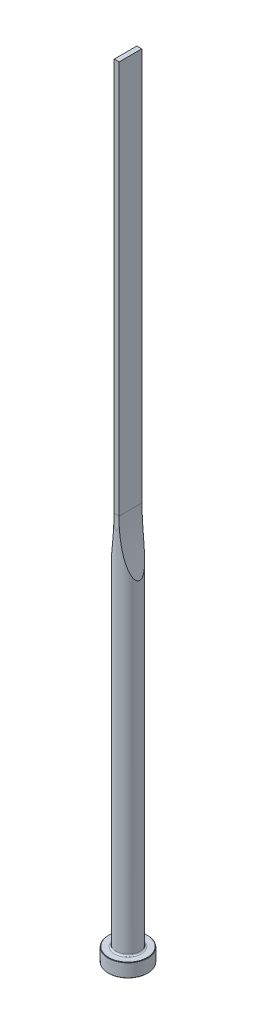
ISO-10303-21;
HEADER;
FILE_DESCRIPTION(('STEP AP214'),'2;1');
FILE_NAME('part.step','',(''),(''),'','','');
FILE_SCHEMA(('AUTOMOTIVE_DESIGN { 1 0 10303 214 1 1 1 1 }'));
ENDSEC;
DATA;
#1=APPLICATION_CONTEXT('core data for automotive mechanical design processes');
#2=APPLICATION_PROTOCOL_DEFINITION('international standard','automotive_design',2000,#1);
#3=PRODUCT_CONTEXT('',#1,'mechanical');
#4=PRODUCT('Part','Part','',(#3));
#5=PRODUCT_RELATED_PRODUCT_CATEGORY('part','',(#4));
#6=PRODUCT_DEFINITION_FORMATION('','',#4);
#7=PRODUCT_DEFINITION_CONTEXT('part definition',#1,'design');
#8=PRODUCT_DEFINITION('design','',#6,#7);
#9=PRODUCT_DEFINITION_SHAPE('','',#8);
#10=(LENGTH_UNIT() NAMED_UNIT(*) SI_UNIT(.MILLI.,.METRE.));
#11=(NAMED_UNIT(*) PLANE_ANGLE_UNIT() SI_UNIT($,.RADIAN.));
#12=(NAMED_UNIT(*) SI_UNIT($,.STERADIAN.) SOLID_ANGLE_UNIT());
#13=UNCERTAINTY_MEASURE_WITH_UNIT(LENGTH_MEASURE(1.E-05),#10,'distance_accuracy_value','');
#14=(GEOMETRIC_REPRESENTATION_CONTEXT(3) GLOBAL_UNCERTAINTY_ASSIGNED_CONTEXT((#13)) GLOBAL_UNIT_ASSIGNED_CONTEXT((#10,
#11,#12)) REPRESENTATION_CONTEXT('',''));
#15=CARTESIAN_POINT('',(0.,0.,0.));
#16=DIRECTION('',(0.,0.,1.));
#17=DIRECTION('',(1.,0.,0.));
#18=AXIS2_PLACEMENT_3D('',#15,#16,#17);
#19=CARTESIAN_POINT('',(0.,0.,0.));
#20=DIRECTION('',(0.,1.,0.));
#21=DIRECTION('',(-1.,0.,0.));
#22=AXIS2_PLACEMENT_3D('',#19,#20,#21);
#23=PLANE('',#22);
#24=CARTESIAN_POINT('',(0.,0.,0.));
#25=DIRECTION('',(0.,1.,0.));
#26=DIRECTION('',(-1.,0.,0.));
#27=AXIS2_PLACEMENT_3D('',#24,#25,#26);
#28=CIRCLE('',#27,9.8);
#29=CARTESIAN_POINT('',(-9.8,0.,0.));
#30=VERTEX_POINT('',#29);
#31=EDGE_CURVE('E133',#30,#30,#28,.T.);
#32=ORIENTED_EDGE('',*,*,#31,.F.);
#33=EDGE_LOOP('',(#32));
#34=FACE_BOUND('',#33,.T.);
#35=ADVANCED_FACE('F32',(#34),#23,.F.);
#36=CARTESIAN_POINT('',(0.,0.,0.));
#37=DIRECTION('',(0.,1.,0.));
#38=DIRECTION('',(-1.,0.,0.));
#39=AXIS2_PLACEMENT_3D('',#36,#37,#38);
#40=CONICAL_SURFACE('',#39,9.8,0.785398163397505);
#41=CARTESIAN_POINT('',(0.,0.199999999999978,0.));
#42=DIRECTION('',(0.,1.,0.));
#43=DIRECTION('',(-1.,0.,0.));
#44=AXIS2_PLACEMENT_3D('',#41,#42,#43);
#45=CIRCLE('',#44,10.);
#46=CARTESIAN_POINT('',(-10.,0.199999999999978,0.));
#47=VERTEX_POINT('',#46);
#48=EDGE_CURVE('E130',#47,#47,#45,.T.);
#49=ORIENTED_EDGE('',*,*,#48,.F.);
#50=EDGE_LOOP('',(#49));
#51=FACE_BOUND('',#50,.T.);
#52=ORIENTED_EDGE('',*,*,#31,.T.);
#53=EDGE_LOOP('',(#52));
#54=FACE_BOUND('',#53,.T.);
#55=ADVANCED_FACE('F171',(#51,#54),#40,.T.);
#56=CARTESIAN_POINT('',(0.,400.,0.));
#57=DIRECTION('',(0.,1.,0.));
#58=DIRECTION('',(-1.,0.,0.));
#59=AXIS2_PLACEMENT_3D('',#56,#57,#58);
#60=CYLINDRICAL_SURFACE('',#59,10.);
#61=CARTESIAN_POINT('',(0.,6.80000000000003,0.));
#62=DIRECTION('',(0.,1.,0.));
#63=DIRECTION('',(-1.,0.,0.));
#64=AXIS2_PLACEMENT_3D('',#61,#62,#63);
#65=CIRCLE('',#64,10.);
#66=CARTESIAN_POINT('',(-10.,6.80000000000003,0.));
#67=VERTEX_POINT('',#66);
#68=EDGE_CURVE('E127',#67,#67,#65,.T.);
#69=ORIENTED_EDGE('',*,*,#68,.F.);
#70=EDGE_LOOP('',(#69));
#71=FACE_BOUND('',#70,.T.);
#72=ORIENTED_EDGE('',*,*,#48,.T.);
#73=EDGE_LOOP('',(#72));
#74=FACE_BOUND('',#73,.T.);
#75=ADVANCED_FACE('F176',(#71,#74),#60,.T.);
#76=CARTESIAN_POINT('',(0.,6.80000000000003,0.));
#77=DIRECTION('',(0.,-1.,0.));
#78=DIRECTION('',(1.,0.,0.));
#79=AXIS2_PLACEMENT_3D('',#76,#77,#78);
#80=CONICAL_SURFACE('',#79,10.,0.785398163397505);
#81=CARTESIAN_POINT('',(0.,7.00000000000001,0.));
#82=DIRECTION('',(0.,1.,0.));
#83=DIRECTION('',(-1.,0.,0.));
#84=AXIS2_PLACEMENT_3D('',#81,#82,#83);
#85=CIRCLE('',#84,9.8);
#86=CARTESIAN_POINT('',(-9.8,7.00000000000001,0.));
#87=VERTEX_POINT('',#86);
#88=EDGE_CURVE('E124',#87,#87,#85,.T.);
#89=ORIENTED_EDGE('',*,*,#88,.F.);
#90=EDGE_LOOP('',(#89));
#91=FACE_BOUND('',#90,.T.);
#92=ORIENTED_EDGE('',*,*,#68,.T.);
#93=EDGE_LOOP('',(#92));
#94=FACE_BOUND('',#93,.T.);
#95=ADVANCED_FACE('F183',(#91,#94),#80,.T.);
#96=CARTESIAN_POINT('',(9.8,7.,0.));
#97=DIRECTION('',(0.,-1.,0.));
#98=DIRECTION('',(1.,0.,0.));
#99=AXIS2_PLACEMENT_3D('',#96,#97,#98);
#100=PLANE('',#99);
#101=CARTESIAN_POINT('',(0.,7.00000000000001,0.));
#102=DIRECTION('',(0.,1.,0.));
#103=DIRECTION('',(-1.,0.,0.));
#104=AXIS2_PLACEMENT_3D('',#101,#102,#103);
#105=CIRCLE('',#104,6.80000000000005);
#106=CARTESIAN_POINT('',(-6.80000000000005,7.00000000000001,0.));
#107=VERTEX_POINT('',#106);
#108=EDGE_CURVE('E121',#107,#107,#105,.T.);
#109=ORIENTED_EDGE('',*,*,#108,.F.);
#110=EDGE_LOOP('',(#109));
#111=FACE_BOUND('',#110,.T.);
#112=ORIENTED_EDGE('',*,*,#88,.T.);
#113=EDGE_LOOP('',(#112));
#114=FACE_BOUND('',#113,.T.);
#115=ADVANCED_FACE('F190',(#111,#114),#100,.F.);
#116=CARTESIAN_POINT('',(0.,7.8,0.));
#117=DIRECTION('',(0.,1.,0.));
#118=DIRECTION('',(-1.,0.,0.));
#119=AXIS2_PLACEMENT_3D('',#116,#117,#118);
#120=TOROIDAL_SURFACE('',#119,6.80000000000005,0.8);
#121=CARTESIAN_POINT('',(0.,7.79999999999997,0.));
#122=DIRECTION('',(0.,1.,0.));
#123=DIRECTION('',(-1.,0.,0.));
#124=AXIS2_PLACEMENT_3D('',#121,#122,#123);
#125=CIRCLE('',#124,6.00000000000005);
#126=CARTESIAN_POINT('',(-6.00000000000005,7.79999999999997,0.));
#127=VERTEX_POINT('',#126);
#128=EDGE_CURVE('E112',#127,#127,#125,.T.);
#129=ORIENTED_EDGE('',*,*,#128,.F.);
#130=EDGE_LOOP('',(#129));
#131=FACE_BOUND('',#130,.T.);
#132=ORIENTED_EDGE('',*,*,#108,.T.);
#133=EDGE_LOOP('',(#132));
#134=FACE_BOUND('',#133,.T.);
#135=ADVANCED_FACE('F168',(#131,#134),#120,.F.);
#136=CARTESIAN_POINT('',(0.,400.,0.));
#137=DIRECTION('',(0.,1.,0.));
#138=DIRECTION('',(-1.,0.,0.));
#139=AXIS2_PLACEMENT_3D('',#136,#137,#138);
#140=CYLINDRICAL_SURFACE('',#139,6.00000000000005);
#141=CARTESIAN_POINT('',(6.00000000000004,171.148007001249,0.));
#142=CARTESIAN_POINT('',(5.99999252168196,171.148028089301,0.122644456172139));
#143=CARTESIAN_POINT('',(5.99618793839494,171.159263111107,0.24542263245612));
#144=CARTESIAN_POINT('',(5.98145295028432,171.202858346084,0.486778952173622));
#145=CARTESIAN_POINT('',(5.97050767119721,171.235262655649,0.605347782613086));
#146=CARTESIAN_POINT('',(5.93958053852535,171.327100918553,0.861102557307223));
#147=CARTESIAN_POINT('',(5.91812144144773,171.390970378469,0.996490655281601));
#148=CARTESIAN_POINT('',(5.86882600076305,171.5384269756,1.25470245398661));
#149=CARTESIAN_POINT('',(5.84097779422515,171.622050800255,1.37750215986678));
#150=CARTESIAN_POINT('',(5.78605390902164,171.787941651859,1.59109296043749));
#151=CARTESIAN_POINT('',(5.75964606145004,171.868040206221,1.68378290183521));
#152=CARTESIAN_POINT('',(5.70466987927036,172.035660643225,1.8615605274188));
#153=CARTESIAN_POINT('',(5.67609999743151,172.12318784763,1.94664267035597));
#154=CARTESIAN_POINT('',(5.61738220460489,172.304082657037,2.11011216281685));
#155=CARTESIAN_POINT('',(5.58723113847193,172.39746201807,2.18848523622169));
#156=CARTESIAN_POINT('',(5.52586683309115,172.588632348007,2.33910280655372));
#157=CARTESIAN_POINT('',(5.49465385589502,172.686422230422,2.41134880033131));
#158=CARTESIAN_POINT('',(5.42118146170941,172.918030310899,2.57314390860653));
#159=CARTESIAN_POINT('',(5.3786422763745,173.053188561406,2.66064244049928));
#160=CARTESIAN_POINT('',(5.2928161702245,173.328229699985,2.82752434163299));
#161=CARTESIAN_POINT('',(5.24952893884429,173.468114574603,2.90690424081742));
#162=CARTESIAN_POINT('',(5.16253997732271,173.75173787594,3.05873243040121));
#163=CARTESIAN_POINT('',(5.11883772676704,173.895481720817,3.13117024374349));
#164=CARTESIAN_POINT('',(5.03135510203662,174.185889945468,3.26989103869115));
#165=CARTESIAN_POINT('',(4.98757471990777,174.332554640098,3.33617335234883));
#166=CARTESIAN_POINT('',(4.8999465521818,174.628909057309,3.46360040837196));
#167=CARTESIAN_POINT('',(4.85609934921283,174.778609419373,3.52472070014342));
#168=CARTESIAN_POINT('',(4.76868885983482,175.079979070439,3.64210927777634));
#169=CARTESIAN_POINT('',(4.72512558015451,175.231648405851,3.6983774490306));
#170=CARTESIAN_POINT('',(4.63844333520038,175.536489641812,3.80652609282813));
#171=CARTESIAN_POINT('',(4.59532398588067,175.689659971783,3.85841069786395));
#172=CARTESIAN_POINT('',(4.5095793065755,175.997397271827,3.95828528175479));
#173=CARTESIAN_POINT('',(4.46695397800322,176.151964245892,4.00627524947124));
#174=CARTESIAN_POINT('',(4.35547403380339,176.560496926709,4.12799496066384));
#175=CARTESIAN_POINT('',(4.28709072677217,176.81546628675,4.19879530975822));
#176=CARTESIAN_POINT('',(4.15206995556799,177.327972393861,4.33235742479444));
#177=CARTESIAN_POINT('',(4.08543269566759,177.585509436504,4.39511825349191));
#178=CARTESIAN_POINT('',(3.95405098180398,178.102773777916,4.51368089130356));
#179=CARTESIAN_POINT('',(3.88930733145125,178.362501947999,4.56947977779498));
#180=CARTESIAN_POINT('',(3.76186381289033,178.883702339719,4.67495531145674));
#181=CARTESIAN_POINT('',(3.69916405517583,179.145174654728,4.7246316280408));
#182=CARTESIAN_POINT('',(3.51405122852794,179.932752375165,4.86576303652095));
#183=CARTESIAN_POINT('',(3.39486370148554,180.46107811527,4.94911108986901));
#184=CARTESIAN_POINT('',(3.16559819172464,181.522097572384,5.09879116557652));
#185=CARTESIAN_POINT('',(3.05552118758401,182.054791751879,5.16512136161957));
#186=CARTESIAN_POINT('',(2.89730686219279,182.857180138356,5.25445264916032));
#187=CARTESIAN_POINT('',(2.84564290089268,183.125627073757,5.28257204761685));
#188=CARTESIAN_POINT('',(2.74471435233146,183.663255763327,5.33570962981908));
#189=CARTESIAN_POINT('',(2.69544957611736,183.93243745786,5.36072805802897));
#190=CARTESIAN_POINT('',(2.55127641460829,184.74102766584,5.43161935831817));
#191=CARTESIAN_POINT('',(2.45999450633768,185.28145438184,5.47332531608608));
#192=CARTESIAN_POINT('',(2.28733028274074,186.363890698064,5.54769584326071));
#193=CARTESIAN_POINT('',(2.20593745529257,186.905897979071,5.58037006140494));
#194=CARTESIAN_POINT('',(2.0530199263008,187.991697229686,5.63842140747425));
#195=CARTESIAN_POINT('',(1.98149538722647,188.535489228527,5.66379841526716));
#196=CARTESIAN_POINT('',(1.8484454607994,189.623953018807,5.70860472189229));
#197=CARTESIAN_POINT('',(1.78690963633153,190.168623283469,5.72804024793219));
#198=CARTESIAN_POINT('',(1.67378553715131,191.259157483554,5.76211157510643));
#199=CARTESIAN_POINT('',(1.62219752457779,191.805021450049,5.77674724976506));
#200=CARTESIAN_POINT('',(1.52899515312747,192.897746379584,5.80211213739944));
#201=CARTESIAN_POINT('',(1.48738183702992,193.444607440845,5.81284094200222));
#202=CARTESIAN_POINT('',(1.41415608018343,194.539052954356,5.8310878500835));
#203=CARTESIAN_POINT('',(1.38254367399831,195.086637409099,5.83860594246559));
#204=CARTESIAN_POINT('',(1.32930623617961,196.182893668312,5.85095649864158));
#205=CARTESIAN_POINT('',(1.30769165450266,196.731566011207,5.85578615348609));
#206=CARTESIAN_POINT('',(1.27450748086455,197.829230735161,5.86309807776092));
#207=CARTESIAN_POINT('',(1.26293790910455,198.378223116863,5.86558034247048));
#208=CARTESIAN_POINT('',(1.2498489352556,199.476293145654,5.86838327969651));
#209=CARTESIAN_POINT('',(1.24832880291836,200.025370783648,5.86870410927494));
#210=CARTESIAN_POINT('',(1.25533745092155,201.123471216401,5.8672089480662));
#211=CARTESIAN_POINT('',(1.26386645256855,201.672494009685,5.86539291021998));
#212=CARTESIAN_POINT('',(1.29090061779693,202.767455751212,5.85950219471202));
#213=CARTESIAN_POINT('',(1.30935423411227,203.313396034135,5.85543918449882));
#214=CARTESIAN_POINT('',(1.35619619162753,204.404812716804,5.84476769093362));
#215=CARTESIAN_POINT('',(1.38458429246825,204.950289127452,5.83815926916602));
#216=CARTESIAN_POINT('',(1.4512870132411,206.040655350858,5.8219365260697));
#217=CARTESIAN_POINT('',(1.48960280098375,206.585545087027,5.81232185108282));
#218=CARTESIAN_POINT('',(1.57614113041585,207.674460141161,5.78945448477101));
#219=CARTESIAN_POINT('',(1.62436362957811,208.218485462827,5.77620180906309));
#220=CARTESIAN_POINT('',(1.73063067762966,209.30484001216,5.74525700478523));
#221=CARTESIAN_POINT('',(1.78866423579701,209.847170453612,5.7275698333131));
#222=CARTESIAN_POINT('',(1.91455588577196,210.93049796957,5.68672649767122));
#223=CARTESIAN_POINT('',(1.98241415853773,211.47149501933,5.66357023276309));
#224=CARTESIAN_POINT('',(2.12788564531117,212.551720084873,5.61053441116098));
#225=CARTESIAN_POINT('',(2.20549657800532,213.090948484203,5.5806564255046));
#226=CARTESIAN_POINT('',(2.37040873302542,214.167381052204,5.51263391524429));
#227=CARTESIAN_POINT('',(2.45770935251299,214.704585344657,5.47448990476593));
#228=CARTESIAN_POINT('',(2.59201282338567,215.486234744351,5.41143537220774));
#229=CARTESIAN_POINT('',(2.63523328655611,215.731661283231,5.39054625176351));
#230=CARTESIAN_POINT('',(2.72367149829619,216.221936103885,5.34640580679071));
#231=CARTESIAN_POINT('',(2.76888920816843,216.466784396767,5.3231545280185));
#232=CARTESIAN_POINT('',(2.9075217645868,217.200414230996,5.24950501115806));
#233=CARTESIAN_POINT('',(3.00391198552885,217.688257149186,5.19521294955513));
#234=CARTESIAN_POINT('',(3.20489967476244,218.663041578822,5.07370413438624));
#235=CARTESIAN_POINT('',(3.3095332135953,219.149968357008,5.00642847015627));
#236=CARTESIAN_POINT('',(3.52630573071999,220.119644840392,4.8561931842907));
#237=CARTESIAN_POINT('',(3.63844279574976,220.60239557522,4.77323755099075));
#238=CARTESIAN_POINT('',(3.81257994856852,221.325101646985,4.63355313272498));
#239=CARTESIAN_POINT('',(3.87196156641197,221.567109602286,4.58413142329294));
#240=CARTESIAN_POINT('',(3.99243307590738,222.049462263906,4.47960383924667));
#241=CARTESIAN_POINT('',(4.05352287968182,222.289807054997,4.42449825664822));
#242=CARTESIAN_POINT('',(4.17737477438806,222.768821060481,4.30775940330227));
#243=CARTESIAN_POINT('',(4.24013887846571,223.007487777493,4.24611798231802));
#244=CARTESIAN_POINT('',(4.36710464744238,223.482395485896,4.11542247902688));
#245=CARTESIAN_POINT('',(4.43130623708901,223.718636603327,4.04636878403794));
#246=CARTESIAN_POINT('',(4.56043310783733,224.186305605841,3.90024206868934));
#247=CARTESIAN_POINT('',(4.62534899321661,224.41775655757,3.82323498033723));
#248=CARTESIAN_POINT('',(4.75610292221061,224.876952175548,3.65930202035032));
#249=CARTESIAN_POINT('',(4.82194117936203,225.104695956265,3.57237381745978));
#250=CARTESIAN_POINT('',(4.95392961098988,225.554707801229,3.38696166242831));
#251=CARTESIAN_POINT('',(5.02007870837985,225.776987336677,3.28850496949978));
#252=CARTESIAN_POINT('',(5.15215404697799,226.214748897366,3.0774734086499));
#253=CARTESIAN_POINT('',(5.21808040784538,226.430235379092,2.96490804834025));
#254=CARTESIAN_POINT('',(5.31394944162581,226.739595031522,2.78676803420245));
#255=CARTESIAN_POINT('',(5.34439862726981,226.83724775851,2.72800628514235));
#256=CARTESIAN_POINT('',(5.40485413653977,227.030004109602,2.60618203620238));
#257=CARTESIAN_POINT('',(5.43486041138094,227.125107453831,2.54311906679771));
#258=CARTESIAN_POINT('',(5.49425843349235,227.312312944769,2.41211667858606));
#259=CARTESIAN_POINT('',(5.52364932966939,227.404411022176,2.34417101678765));
#260=CARTESIAN_POINT('',(5.58148621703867,227.584682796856,2.2029120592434));
#261=CARTESIAN_POINT('',(5.60993234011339,227.672857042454,2.12959951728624));
#262=CARTESIAN_POINT('',(5.68541013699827,227.905639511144,1.92239994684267));
#263=CARTESIAN_POINT('',(5.73120270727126,228.045567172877,1.78265212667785));
#264=CARTESIAN_POINT('',(5.81613449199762,228.303231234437,1.482160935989));
#265=CARTESIAN_POINT('',(5.85529370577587,228.421034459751,1.32148335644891));
#266=CARTESIAN_POINT('',(5.90938819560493,228.582936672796,1.04430418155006));
#267=CARTESIAN_POINT('',(5.92782413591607,228.637889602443,0.934890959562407));
#268=CARTESIAN_POINT('',(5.95913398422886,228.73100388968,0.70834570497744));
#269=CARTESIAN_POINT('',(5.97201429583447,228.769184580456,0.591222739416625));
#270=CARTESIAN_POINT('',(5.99098805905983,228.825367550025,0.350358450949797));
#271=CARTESIAN_POINT('',(5.99701510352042,228.843172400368,0.226564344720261));
#272=CARTESIAN_POINT('',(6.00124661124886,228.855677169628,-0.0223197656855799));
#273=CARTESIAN_POINT('',(5.99945446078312,228.850387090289,-0.147409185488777));
#274=CARTESIAN_POINT('',(5.98897538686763,228.819401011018,-0.379606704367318));
#275=CARTESIAN_POINT('',(5.98112361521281,228.796176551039,-0.48710016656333));
#276=CARTESIAN_POINT('',(5.96030773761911,228.734464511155,-0.69705238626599));
#277=CARTESIAN_POINT('',(5.94734054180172,228.695967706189,-0.799508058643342));
#278=CARTESIAN_POINT('',(5.90966135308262,228.583764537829,-1.04821727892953));
#279=CARTESIAN_POINT('',(5.88232531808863,228.50209532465,-1.19045464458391));
#280=CARTESIAN_POINT('',(5.82133461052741,228.318765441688,-1.4598934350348));
#281=CARTESIAN_POINT('',(5.78766248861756,228.217049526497,-1.58705171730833));
#282=CARTESIAN_POINT('',(5.72023684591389,228.011961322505,-1.81419145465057));
#283=CARTESIAN_POINT('',(5.68690674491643,227.91002456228,-1.91562288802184));
#284=CARTESIAN_POINT('',(5.6180716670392,227.698109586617,-2.10898431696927));
#285=CARTESIAN_POINT('',(5.58256487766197,227.58812465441,-2.20090621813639));
#286=CARTESIAN_POINT('',(5.5100627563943,227.361968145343,-2.37660535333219));
#287=CARTESIAN_POINT('',(5.47306450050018,227.245784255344,-2.46036536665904));
#288=CARTESIAN_POINT('',(5.39817254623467,227.008872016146,-2.62059961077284));
#289=CARTESIAN_POINT('',(5.36027914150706,226.888145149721,-2.69707619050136));
#290=CARTESIAN_POINT('',(5.26718075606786,226.589262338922,-2.87593311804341));
#291=CARTESIAN_POINT('',(5.21168426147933,226.409178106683,-2.97493259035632));
#292=CARTESIAN_POINT('',(5.10029937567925,226.043534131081,-3.16208569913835));
#293=CARTESIAN_POINT('',(5.04441080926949,225.857971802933,-3.25023411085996));
#294=CARTESIAN_POINT('',(4.93265417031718,225.482430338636,-3.417462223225));
#295=CARTESIAN_POINT('',(4.87678628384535,225.292444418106,-3.49652671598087));
#296=CARTESIAN_POINT('',(4.76549494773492,224.909239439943,-3.64675072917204));
#297=CARTESIAN_POINT('',(4.71007154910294,224.716020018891,-3.71790935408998));
#298=CARTESIAN_POINT('',(4.59964672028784,224.326067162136,-3.85369192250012));
#299=CARTESIAN_POINT('',(4.54464863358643,224.129321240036,-3.91828254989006));
#300=CARTESIAN_POINT('',(4.43552311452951,223.733704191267,-4.04139805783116));
#301=CARTESIAN_POINT('',(4.38139570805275,223.534833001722,-4.09992275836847));
#302=CARTESIAN_POINT('',(4.27420253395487,223.135542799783,-4.21155238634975));
#303=CARTESIAN_POINT('',(4.22113568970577,222.935125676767,-4.26466306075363));
#304=CARTESIAN_POINT('',(4.11610452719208,222.53280923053,-4.36612054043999));
#305=CARTESIAN_POINT('',(4.06414020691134,222.330909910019,-4.41446735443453));
#306=CARTESIAN_POINT('',(3.92557394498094,221.784635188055,-4.53912486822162));
#307=CARTESIAN_POINT('',(3.84008066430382,221.439061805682,-4.61143245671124));
#308=CARTESIAN_POINT('',(3.67276769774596,220.745020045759,-4.74576314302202));
#309=CARTESIAN_POINT('',(3.59094846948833,220.39655131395,-4.80778496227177));
#310=CARTESIAN_POINT('',(3.43114676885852,219.697150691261,-4.92310289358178));
#311=CARTESIAN_POINT('',(3.35316590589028,219.346217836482,-4.97639536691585));
#312=CARTESIAN_POINT('',(3.20120804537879,218.642420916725,-5.07547918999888));
#313=CARTESIAN_POINT('',(3.12723126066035,218.289556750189,-5.12127014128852));
#314=CARTESIAN_POINT('',(2.98323529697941,217.581496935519,-5.20646913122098));
#315=CARTESIAN_POINT('',(2.91322451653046,217.22629799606,-5.2458639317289));
#316=CARTESIAN_POINT('',(2.77739408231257,216.514517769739,-5.31902413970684));
#317=CARTESIAN_POINT('',(2.71157455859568,216.157936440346,-5.35278937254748));
#318=CARTESIAN_POINT('',(2.52051939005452,215.086596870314,-5.44676258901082));
#319=CARTESIAN_POINT('',(2.40164783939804,214.370049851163,-5.49967045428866));
#320=CARTESIAN_POINT('',(2.18097751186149,212.932107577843,-5.59084552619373));
#321=CARTESIAN_POINT('',(2.07921035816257,212.210705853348,-5.62908577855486));
#322=CARTESIAN_POINT('',(1.89316918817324,210.765123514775,-5.69435012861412));
#323=CARTESIAN_POINT('',(1.80889591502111,210.040942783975,-5.72137374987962));
#324=CARTESIAN_POINT('',(1.65803395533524,208.591282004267,-5.76689841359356));
#325=CARTESIAN_POINT('',(1.59142610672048,207.865804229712,-5.78540870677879));
#326=CARTESIAN_POINT('',(1.4758382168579,206.413319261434,-5.8159657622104));
#327=CARTESIAN_POINT('',(1.4268581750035,205.686312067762,-5.82801252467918));
#328=CARTESIAN_POINT('',(1.33557886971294,204.032134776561,-5.84970538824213));
#329=CARTESIAN_POINT('',(1.29877643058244,203.104636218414,-5.85779222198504));
#330=CARTESIAN_POINT('',(1.25387900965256,201.248889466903,-5.86756279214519));
#331=CARTESIAN_POINT('',(1.24578503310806,200.320641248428,-5.86924630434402));
#332=CARTESIAN_POINT('',(1.25832051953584,198.463635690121,-5.8665730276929));
#333=CARTESIAN_POINT('',(1.27897187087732,197.534878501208,-5.86221163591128));
#334=CARTESIAN_POINT('',(1.3490117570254,195.678537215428,-5.84649034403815));
#335=CARTESIAN_POINT('',(1.39839945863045,194.75095308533,-5.83513064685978));
#336=CARTESIAN_POINT('',(1.52563647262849,192.90104548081,-5.80316878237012));
#337=CARTESIAN_POINT('',(1.60338814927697,191.978714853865,-5.78259826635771));
#338=CARTESIAN_POINT('',(1.74128966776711,190.597611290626,-5.7419640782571));
#339=CARTESIAN_POINT('',(1.7908068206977,190.137609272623,-5.72678817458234));
#340=CARTESIAN_POINT('',(1.89690986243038,189.218569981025,-5.6925264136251));
#341=CARTESIAN_POINT('',(1.95349560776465,188.759532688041,-5.67344063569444));
#342=CARTESIAN_POINT('',(2.07364787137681,187.843042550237,-5.63063453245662));
#343=CARTESIAN_POINT('',(2.13720755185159,187.385588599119,-5.60691872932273));
#344=CARTESIAN_POINT('',(2.27130980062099,186.47203567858,-5.5539492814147));
#345=CARTESIAN_POINT('',(2.34185216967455,186.015936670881,-5.52469579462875));
#346=CARTESIAN_POINT('',(2.48984878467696,185.105429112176,-5.45959598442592));
#347=CARTESIAN_POINT('',(2.56730155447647,184.65102022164,-5.4237510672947));
#348=CARTESIAN_POINT('',(2.72904946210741,183.744125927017,-5.34419515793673));
#349=CARTESIAN_POINT('',(2.81334423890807,183.291640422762,-5.30048458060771));
#350=CARTESIAN_POINT('',(2.96709144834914,182.500050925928,-5.21555922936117));
#351=CARTESIAN_POINT('',(3.03509178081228,182.160446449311,-5.1763772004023));
#352=CARTESIAN_POINT('',(3.17485079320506,181.482770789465,-5.09185601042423));
#353=CARTESIAN_POINT('',(3.24660950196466,181.144699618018,-5.04651680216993));
#354=CARTESIAN_POINT('',(3.39372907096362,180.470674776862,-4.94877727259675));
#355=CARTESIAN_POINT('',(3.46908674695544,180.134719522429,-4.89638312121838));
#356=CARTESIAN_POINT('',(3.62333606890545,179.465009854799,-4.78336577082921));
#357=CARTESIAN_POINT('',(3.70222757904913,179.131255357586,-4.72274288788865));
#358=CARTESIAN_POINT('',(3.83929146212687,178.56578525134,-4.61141276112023));
#359=CARTESIAN_POINT('',(3.8966107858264,178.333379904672,-4.56315560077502));
#360=CARTESIAN_POINT('',(4.01281641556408,177.870137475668,-4.46130900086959));
#361=CARTESIAN_POINT('',(4.07170266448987,177.639300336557,-4.4077197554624));
#362=CARTESIAN_POINT('',(4.19104857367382,177.179053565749,-4.29440309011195));
#363=CARTESIAN_POINT('',(4.25151096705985,176.949647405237,-4.23466439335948));
#364=CARTESIAN_POINT('',(4.37375740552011,176.493100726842,-4.10828145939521));
#365=CARTESIAN_POINT('',(4.43554140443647,176.265960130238,-4.04163746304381));
#366=CARTESIAN_POINT('',(4.56691534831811,175.79029041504,-3.89283650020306));
#367=CARTESIAN_POINT('',(4.63663289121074,175.542074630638,-3.80978259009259));
#368=CARTESIAN_POINT('',(4.77710170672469,175.049983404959,-3.63209895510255));
#369=CARTESIAN_POINT('',(4.84785329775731,174.806109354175,-3.53746559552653));
#370=CARTESIAN_POINT('',(4.98957510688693,174.325075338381,-3.33457940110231));
#371=CARTESIAN_POINT('',(5.06054393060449,174.087896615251,-3.22637048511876));
#372=CARTESIAN_POINT('',(5.20199383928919,173.621983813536,-2.9929798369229));
#373=CARTESIAN_POINT('',(5.27247528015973,173.393242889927,-2.86781226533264));
#374=CARTESIAN_POINT('',(5.39502311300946,173.000839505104,-2.6281683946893));
#375=CARTESIAN_POINT('',(5.44749923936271,172.834589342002,-2.51817503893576));
#376=CARTESIAN_POINT('',(5.55029648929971,172.512012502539,-2.28270917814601));
#377=CARTESIAN_POINT('',(5.60061350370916,172.35570449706,-2.15720878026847));
#378=CARTESIAN_POINT('',(5.69770401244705,172.056671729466,-1.88606041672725));
#379=CARTESIAN_POINT('',(5.74443119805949,171.914119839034,-1.7402013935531));
#380=CARTESIAN_POINT('',(5.83039285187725,171.653759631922,-1.42578179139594));
#381=CARTESIAN_POINT('',(5.86965408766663,171.535862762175,-1.25730615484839));
#382=CARTESIAN_POINT('',(5.92189290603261,171.37976321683,-0.970960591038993));
#383=CARTESIAN_POINT('',(5.93903183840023,171.328747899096,-0.86088461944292));
#384=CARTESIAN_POINT('',(5.96754078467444,171.244058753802,-0.633614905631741));
#385=CARTESIAN_POINT('',(5.97892566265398,171.210340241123,-0.516440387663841));
#386=CARTESIAN_POINT('',(5.99117669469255,171.174087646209,-0.331820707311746));
#387=CARTESIAN_POINT('',(5.9944715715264,171.164346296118,-0.265899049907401));
#388=CARTESIAN_POINT('',(5.99888554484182,171.151299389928,-0.133331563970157));
#389=CARTESIAN_POINT('',(6.00000406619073,171.147995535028,-0.0666855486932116));
#390=CARTESIAN_POINT('',(6.00000000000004,171.148007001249,0.));
#391=B_SPLINE_CURVE_WITH_KNOTS('',3,(#141,#142,#143,#144,#145,#146,#147,#148,#149,#150,#151,
#152,#153,#154,#155,#156,#157,#158,#159,#160,#161,#162,#163,#164,#165,#166,#167,#168,#169,#170,
#171,#172,#173,#174,#175,#176,#177,#178,#179,#180,#181,#182,#183,#184,#185,#186,#187,#188,#189,
#190,#191,#192,#193,#194,#195,#196,#197,#198,#199,#200,#201,#202,#203,#204,#205,#206,#207,#208,
#209,#210,#211,#212,#213,#214,#215,#216,#217,#218,#219,#220,#221,#222,#223,#224,#225,#226,#227,
#228,#229,#230,#231,#232,#233,#234,#235,#236,#237,#238,#239,#240,#241,#242,#243,#244,#245,#246,
#247,#248,#249,#250,#251,#252,#253,#254,#255,#256,#257,#258,#259,#260,#261,#262,#263,#264,#265,
#266,#267,#268,#269,#270,#271,#272,#273,#274,#275,#276,#277,#278,#279,#280,#281,#282,#283,#284,
#285,#286,#287,#288,#289,#290,#291,#292,#293,#294,#295,#296,#297,#298,#299,#300,#301,#302,#303,
#304,#305,#306,#307,#308,#309,#310,#311,#312,#313,#314,#315,#316,#317,#318,#319,#320,#321,#322,
#323,#324,#325,#326,#327,#328,#329,#330,#331,#332,#333,#334,#335,#336,#337,#338,#339,#340,#341,
#342,#343,#344,#345,#346,#347,#348,#349,#350,#351,#352,#353,#354,#355,#356,#357,#358,#359,#360,
#361,#362,#363,#364,#365,#366,#367,#368,#369,#370,#371,#372,#373,#374,#375,#376,#377,#378,#379,
#380,#381,#382,#383,#384,#385,#386,#387,#388,#389,#390),.UNSPECIFIED.,.T.,.F.,(4,2,2,2,2,2,2,2,
2,2,2,2,2,2,2,2,2,2,2,2,2,2,2,2,2,2,2,2,2,2,2,2,2,2,2,2,2,2,2,2,2,2,2,2,2,2,2,2,2,2,2,2,2,2,2,2,
2,2,2,2,2,2,2,2,2,2,2,2,2,2,2,2,2,2,2,2,2,2,2,2,2,2,2,2,2,2,2,2,2,2,2,2,2,2,2,2,2,2,2,2,2,2,2,2,
2,2,2,2,2,2,2,2,2,2,2,2,2,2,2,2,2,2,2,2,4),(0.,0.36763219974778,0.736032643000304,
1.18715483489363,1.63912152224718,2.01454826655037,2.39024626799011,2.76672480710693,
3.14311110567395,3.64236820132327,4.14183780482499,4.64204971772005,5.1423158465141,
5.64483223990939,6.14736049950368,6.64940960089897,7.15146013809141,7.9712171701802,
8.79106968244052,9.61126521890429,10.4315050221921,12.0749599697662,13.7185912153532,
14.5430129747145,15.3673696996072,17.0161659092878,18.6631938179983,20.3102488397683,
21.9555716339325,23.6009377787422,25.2464758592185,26.8920196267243,28.5392794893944,
30.186542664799,31.8336861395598,33.4808658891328,35.1195718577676,36.7582381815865,
38.3970973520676,40.0359494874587,41.6729777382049,43.3100361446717,44.9467123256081,
46.5832867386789,47.3335008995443,48.0837005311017,49.5841717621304,51.0916183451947,
52.5986820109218,53.3607433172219,54.1227654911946,54.8857493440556,55.6486933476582,
56.4057552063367,57.1629953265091,57.9184797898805,58.6734578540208,59.0272729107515,
59.3811266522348,59.7354411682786,60.0897060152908,60.6970359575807,61.302500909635,
61.6727478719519,62.0425669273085,62.4159397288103,62.7891508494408,63.1184957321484,
63.4480398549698,63.9440333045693,64.4414132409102,64.8836162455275,65.3261926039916,
65.7696834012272,66.2130306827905,66.8511576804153,67.4895907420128,68.1290775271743,
68.7686366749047,69.4112931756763,70.0539687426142,70.6959548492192,71.3379397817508,
72.4274960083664,73.5171875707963,74.6073322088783,75.697534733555,76.7899656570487,
77.8824304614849,80.0667651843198,82.2550949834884,84.4435177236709,86.6295568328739,
88.8155958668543,91.59989618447,94.384293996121,97.1708131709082,99.9572515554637,
102.734187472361,104.122854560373,105.511493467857,106.898782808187,108.286032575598,
109.6729867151,111.059867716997,112.105464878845,113.151070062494,114.195766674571,
115.240423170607,115.972921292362,116.705392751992,117.439232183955,118.173046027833,
118.985414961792,119.798039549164,120.608099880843,121.417487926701,122.035280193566,
122.654200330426,123.280093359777,123.90369823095,124.270054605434,124.635459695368,
124.835299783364,125.035192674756),.UNSPECIFIED.);
#392=CARTESIAN_POINT('',(1.34687364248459,195.825329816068,-5.84687364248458));
#393=VERTEX_POINT('',#392);
#394=CARTESIAN_POINT('',(1.34687364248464,195.825329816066,5.8468736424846));
#395=VERTEX_POINT('',#394);
#396=EDGE_CURVE('E138',#393,#395,#391,.T.);
#397=ORIENTED_EDGE('',*,*,#396,.T.);
#398=CARTESIAN_POINT('',(-1.71391365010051,200.,5.74999999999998));
#399=CARTESIAN_POINT('',(-1.71391988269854,200.360232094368,5.75000022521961));
#400=CARTESIAN_POINT('',(-1.70670690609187,200.7204849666,5.75216429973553));
#401=CARTESIAN_POINT('',(-1.67730271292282,201.440311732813,5.76080572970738));
#402=CARTESIAN_POINT('',(-1.65511191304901,201.799885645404,5.7672829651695));
#403=CARTESIAN_POINT('',(-1.59385315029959,202.518394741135,5.78452322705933));
#404=CARTESIAN_POINT('',(-1.55474710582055,202.87732663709,5.79529591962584));
#405=CARTESIAN_POINT('',(-1.48033674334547,203.41327242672,5.81457014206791));
#406=CARTESIAN_POINT('',(-1.45292096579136,203.591447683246,5.82151097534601));
#407=CARTESIAN_POINT('',(-1.39191289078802,203.946689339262,5.83640137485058));
#408=CARTESIAN_POINT('',(-1.35832152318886,204.123755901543,5.84435078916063));
#409=CARTESIAN_POINT('',(-1.29127878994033,204.440079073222,5.85948118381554));
#410=CARTESIAN_POINT('',(-1.25921382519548,204.579636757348,5.86648499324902));
#411=CARTESIAN_POINT('',(-1.18926063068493,204.857383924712,5.88106678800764));
#412=CARTESIAN_POINT('',(-1.1513684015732,204.995572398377,5.88864516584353));
#413=CARTESIAN_POINT('',(-1.06831244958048,205.269233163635,5.90427715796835));
#414=CARTESIAN_POINT('',(-1.02317340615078,205.404712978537,5.91232910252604));
#415=CARTESIAN_POINT('',(-0.923002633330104,205.671884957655,5.92880254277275));
#416=CARTESIAN_POINT('',(-0.867986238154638,205.803582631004,5.9372234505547));
#417=CARTESIAN_POINT('',(-0.766634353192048,206.011378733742,5.95094792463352));
#418=CARTESIAN_POINT('',(-0.724867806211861,206.089690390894,5.95622768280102));
#419=CARTESIAN_POINT('',(-0.633381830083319,206.241543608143,5.96665610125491));
#420=CARTESIAN_POINT('',(-0.583681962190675,206.315096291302,5.9718050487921));
#421=CARTESIAN_POINT('',(-0.500547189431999,206.418351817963,5.9791474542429));
#422=CARTESIAN_POINT('',(-0.471478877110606,206.451525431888,5.98152654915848));
#423=CARTESIAN_POINT('',(-0.409756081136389,206.514467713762,5.98607241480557));
#424=CARTESIAN_POINT('',(-0.377102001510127,206.54423676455,5.98823920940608));
#425=CARTESIAN_POINT('',(-0.3149537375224,206.592746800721,5.99179060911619));
#426=CARTESIAN_POINT('',(-0.286256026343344,206.612487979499,5.99324366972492));
#427=CARTESIAN_POINT('',(-0.226115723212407,206.647269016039,5.99581280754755));
#428=CARTESIAN_POINT('',(-0.194679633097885,206.662319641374,5.99692965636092));
#429=CARTESIAN_POINT('',(-0.137318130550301,206.683161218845,5.99847946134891));
#430=CARTESIAN_POINT('',(-0.111895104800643,206.690310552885,5.99901243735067));
#431=CARTESIAN_POINT('',(-0.06020628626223,206.70024307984,5.99975337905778));
#432=CARTESIAN_POINT('',(-0.033941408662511,206.703030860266,5.9999616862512));
#433=CARTESIAN_POINT('',(0.0187279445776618,206.703927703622,6.00002867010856));
#434=CARTESIAN_POINT('',(0.0451325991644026,206.702026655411,5.99988659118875));
#435=CARTESIAN_POINT('',(0.0972283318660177,206.693750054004,5.99926893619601));
#436=CARTESIAN_POINT('',(0.122918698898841,206.687370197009,5.99879303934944));
#437=CARTESIAN_POINT('',(0.180222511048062,206.668376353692,5.99737959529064));
#438=CARTESIAN_POINT('',(0.211408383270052,206.654495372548,5.9963485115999));
#439=CARTESIAN_POINT('',(0.271170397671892,206.62198630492,5.99394413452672));
#440=CARTESIAN_POINT('',(0.299740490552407,206.603347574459,5.99257007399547));
#441=CARTESIAN_POINT('',(0.373829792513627,206.548222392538,5.988527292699));
#442=CARTESIAN_POINT('',(0.416890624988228,206.508492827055,5.98563453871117));
#443=CARTESIAN_POINT('',(0.497042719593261,206.423494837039,5.97951175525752));
#444=CARTESIAN_POINT('',(0.534115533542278,206.378210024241,5.97628073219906));
#445=CARTESIAN_POINT('',(0.61988723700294,206.262394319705,5.96811343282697));
#446=CARTESIAN_POINT('',(0.665945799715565,206.189938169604,5.96308457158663));
#447=CARTESIAN_POINT('',(0.751194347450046,206.041041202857,5.95294302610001));
#448=CARTESIAN_POINT('',(0.790368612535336,205.964591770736,5.94783017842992));
#449=CARTESIAN_POINT('',(0.863732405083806,205.808846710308,5.93762100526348));
#450=CARTESIAN_POINT('',(0.897893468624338,205.729537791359,5.93252492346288));
#451=CARTESIAN_POINT('',(0.962086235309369,205.56938465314,5.92245190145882));
#452=CARTESIAN_POINT('',(0.992122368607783,205.48854218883,5.91747483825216));
#453=CARTESIAN_POINT('',(1.07256047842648,205.257924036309,5.90359472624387));
#454=CARTESIAN_POINT('',(1.11909878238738,205.106793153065,5.89487290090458));
#455=CARTESIAN_POINT('',(1.20416724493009,204.802231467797,5.87808063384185));
#456=CARTESIAN_POINT('',(1.24269263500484,204.648799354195,5.87001058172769));
#457=CARTESIAN_POINT('',(1.3134849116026,204.340145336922,5.85457710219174));
#458=CARTESIAN_POINT('',(1.34573891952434,204.184920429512,5.84721514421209));
#459=CARTESIAN_POINT('',(1.40500539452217,203.873431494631,5.83325598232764));
#460=CARTESIAN_POINT('',(1.43201709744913,203.717167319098,5.82665888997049));
#461=CARTESIAN_POINT('',(1.50637758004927,203.247239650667,5.80805390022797));
#462=CARTESIAN_POINT('',(1.54704655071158,202.932464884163,5.79723348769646));
#463=CARTESIAN_POINT('',(1.61419698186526,202.301766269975,5.77888587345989));
#464=CARTESIAN_POINT('',(1.64069532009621,201.985844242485,5.77135475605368));
#465=CARTESIAN_POINT('',(1.68834801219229,201.246171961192,5.75763237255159));
#466=CARTESIAN_POINT('',(1.70466595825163,200.822080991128,5.75275515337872));
#467=CARTESIAN_POINT('',(1.71726032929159,199.973290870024,5.74900212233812));
#468=CARTESIAN_POINT('',(1.7135214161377,199.548591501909,5.75013090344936));
#469=CARTESIAN_POINT('',(1.68556859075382,198.699396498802,5.75839581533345));
#470=CARTESIAN_POINT('',(1.66133235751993,198.27490159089,5.76553849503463));
#471=CARTESIAN_POINT('',(1.60743023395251,197.639971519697,5.78069922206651));
#472=CARTESIAN_POINT('',(1.58655066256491,197.42871844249,5.78649055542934));
#473=CARTESIAN_POINT('',(1.53819978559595,197.007023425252,5.79953269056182));
#474=CARTESIAN_POINT('',(1.51072919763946,196.796581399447,5.80678333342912));
#475=CARTESIAN_POINT('',(1.44802861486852,196.376216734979,5.82273739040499));
#476=CARTESIAN_POINT('',(1.41277459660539,196.16629778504,5.83144528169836));
#477=CARTESIAN_POINT('',(1.33275702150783,195.7480308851,5.85025220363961));
#478=CARTESIAN_POINT('',(1.28798068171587,195.539685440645,5.860353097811));
#479=CARTESIAN_POINT('',(1.18625496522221,195.12669527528,5.88179991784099));
#480=CARTESIAN_POINT('',(1.12934956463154,194.922040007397,5.89314127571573));
#481=CARTESIAN_POINT('',(1.03065050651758,194.61967885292,5.91090853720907));
#482=CARTESIAN_POINT('',(0.995571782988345,194.519766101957,5.91694999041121));
#483=CARTESIAN_POINT('',(0.919681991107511,194.322175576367,5.92922251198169));
#484=CARTESIAN_POINT('',(0.878874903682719,194.224496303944,5.93545344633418));
#485=CARTESIAN_POINT('',(0.789300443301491,194.032115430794,5.9480305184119));
#486=CARTESIAN_POINT('',(0.740485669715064,193.937435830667,5.95437712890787));
#487=CARTESIAN_POINT('',(0.631843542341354,193.754833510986,5.96689426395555));
#488=CARTESIAN_POINT('',(0.572086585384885,193.666872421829,5.97306563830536));
#489=CARTESIAN_POINT('',(0.479606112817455,193.557948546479,5.98084712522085));
#490=CARTESIAN_POINT('',(0.454538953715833,193.530582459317,5.98281596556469));
#491=CARTESIAN_POINT('',(0.401755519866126,193.478381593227,5.98659336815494));
#492=CARTESIAN_POINT('',(0.374034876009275,193.453551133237,5.98840165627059));
#493=CARTESIAN_POINT('',(0.315263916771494,193.407326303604,5.99178479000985));
#494=CARTESIAN_POINT('',(0.28417871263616,193.385975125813,5.99335668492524));
#495=CARTESIAN_POINT('',(0.218804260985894,193.348886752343,5.99609735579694));
#496=CARTESIAN_POINT('',(0.184526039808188,193.33313107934,5.99726745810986));
#497=CARTESIAN_POINT('',(0.124190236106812,193.312996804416,5.99876570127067));
#498=CARTESIAN_POINT('',(0.0988107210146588,193.306614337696,5.99924175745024));
#499=CARTESIAN_POINT('',(0.0473358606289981,193.298218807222,5.99986825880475));
#500=CARTESIAN_POINT('',(0.0212412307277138,193.296201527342,6.0000190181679));
#501=CARTESIAN_POINT('',(-0.0309265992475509,193.296763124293,5.9999770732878));
#502=CARTESIAN_POINT('',(-0.0569997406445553,193.299347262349,5.99978397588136));
#503=CARTESIAN_POINT('',(-0.108346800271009,193.308825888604,5.99907682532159));
#504=CARTESIAN_POINT('',(-0.133619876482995,193.315724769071,5.99856244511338));
#505=CARTESIAN_POINT('',(-0.191093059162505,193.336109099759,5.99704633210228));
#506=CARTESIAN_POINT('',(-0.22277668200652,193.351026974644,5.99593905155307));
#507=CARTESIAN_POINT('',(-0.283384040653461,193.38564482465,5.99338125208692));
#508=CARTESIAN_POINT('',(-0.312301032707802,193.405356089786,5.99192992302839));
#509=CARTESIAN_POINT('',(-0.388084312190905,193.464051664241,5.98763173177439));
#510=CARTESIAN_POINT('',(-0.432258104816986,193.506448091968,5.98455118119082));
#511=CARTESIAN_POINT('',(-0.514319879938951,193.596851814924,5.97805681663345));
#512=CARTESIAN_POINT('',(-0.552188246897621,193.644875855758,5.97464201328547));
#513=CARTESIAN_POINT('',(-0.640778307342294,193.768986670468,5.96592566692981));
#514=CARTESIAN_POINT('',(-0.688534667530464,193.847158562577,5.96052987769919));
#515=CARTESIAN_POINT('',(-0.776702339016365,194.007595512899,5.94967920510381));
#516=CARTESIAN_POINT('',(-0.817096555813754,194.089869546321,5.94422421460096));
#517=CARTESIAN_POINT('',(-0.892584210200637,194.257340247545,5.93335936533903));
#518=CARTESIAN_POINT('',(-0.927647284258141,194.342550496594,5.92794991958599));
#519=CARTESIAN_POINT('',(-0.993403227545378,194.514514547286,5.91728393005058));
#520=CARTESIAN_POINT('',(-1.02410088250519,194.601266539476,5.91202722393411));
#521=CARTESIAN_POINT('',(-1.1067776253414,194.850522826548,5.89729188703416));
#522=CARTESIAN_POINT('',(-1.15453716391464,195.014436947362,5.88804238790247));
#523=CARTESIAN_POINT('',(-1.24142452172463,195.3446081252,5.87033197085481));
#524=CARTESIAN_POINT('',(-1.28054721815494,195.51086651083,5.86187152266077));
#525=CARTESIAN_POINT('',(-1.35203825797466,195.845210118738,5.84579663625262));
#526=CARTESIAN_POINT('',(-1.38439278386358,196.013298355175,5.83818394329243));
#527=CARTESIAN_POINT('',(-1.44343566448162,196.350513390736,5.82386503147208));
#528=CARTESIAN_POINT('',(-1.4701232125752,196.519640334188,5.81715894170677));
#529=CARTESIAN_POINT('',(-1.54288517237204,197.027777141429,5.79845386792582));
#530=CARTESIAN_POINT('',(-1.58172719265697,197.367881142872,5.78785176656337));
#531=CARTESIAN_POINT('',(-1.64387131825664,198.049158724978,5.77050081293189));
#532=CARTESIAN_POINT('',(-1.66719057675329,198.390330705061,5.76374770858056));
#533=CARTESIAN_POINT('',(-1.69382768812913,198.943114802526,5.75595770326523));
#534=CARTESIAN_POINT('',(-1.70138185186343,199.154516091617,5.75372300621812));
#535=CARTESIAN_POINT('',(-1.71142095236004,199.577275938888,5.75074469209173));
#536=CARTESIAN_POINT('',(-1.71390999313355,199.788634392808,5.74999986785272));
#537=CARTESIAN_POINT('',(-1.71391365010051,200.,5.74999999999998));
#538=B_SPLINE_CURVE_WITH_KNOTS('',3,(#398,#399,#400,#401,#402,#403,#404,#405,#406,#407,#408,
#409,#410,#411,#412,#413,#414,#415,#416,#417,#418,#419,#420,#421,#422,#423,#424,#425,#426,#427,
#428,#429,#430,#431,#432,#433,#434,#435,#436,#437,#438,#439,#440,#441,#442,#443,#444,#445,#446,
#447,#448,#449,#450,#451,#452,#453,#454,#455,#456,#457,#458,#459,#460,#461,#462,#463,#464,#465,
#466,#467,#468,#469,#470,#471,#472,#473,#474,#475,#476,#477,#478,#479,#480,#481,#482,#483,#484,
#485,#486,#487,#488,#489,#490,#491,#492,#493,#494,#495,#496,#497,#498,#499,#500,#501,#502,#503,
#504,#505,#506,#507,#508,#509,#510,#511,#512,#513,#514,#515,#516,#517,#518,#519,#520,#521,#522,
#523,#524,#525,#526,#527,#528,#529,#530,#531,#532,#533,#534,#535,#536,#537),.UNSPECIFIED.,.T.,
.F.,(4,2,2,2,2,2,2,2,2,2,2,2,2,2,2,2,2,2,2,2,2,2,2,2,2,2,2,2,2,2,2,2,2,2,2,2,2,2,2,2,2,2,2,2,2,
2,2,2,2,2,2,2,2,2,2,2,2,2,2,2,2,2,2,2,2,2,2,2,2,4),(0.,1.08064493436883,2.1612598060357,
3.24432025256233,3.78545511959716,4.32650857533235,4.75651025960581,5.18680838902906,
5.61567104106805,6.0438735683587,6.31035401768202,6.57618727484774,6.70851662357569,
6.84083107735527,6.94511015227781,7.04914805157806,7.12806303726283,7.20689496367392,
7.2858970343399,7.36497512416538,7.46685047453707,7.56895576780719,7.74394337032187,
7.91946020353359,8.17682522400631,8.43477049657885,8.69412793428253,8.95320460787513,
9.42797578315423,9.90302869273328,10.3790470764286,10.8551347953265,11.8073834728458,
12.7584954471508,14.0312004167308,15.3048788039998,16.5799459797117,17.2169454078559,
17.853875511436,18.4927996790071,19.1325870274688,19.7700930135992,20.0881688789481,
20.4060247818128,20.7258349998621,21.0436557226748,21.1550136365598,21.2665581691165,
21.3793963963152,21.4918584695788,21.5700494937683,21.6481649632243,21.7263698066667,
21.8046543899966,21.909170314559,22.0139348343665,22.1968116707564,22.38024719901,
22.654847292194,22.9300770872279,23.2068200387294,23.4832572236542,23.995821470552,
24.5086889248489,25.0225934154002,25.5365710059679,26.5634918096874,27.5892759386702,
28.2238570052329,28.8579236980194),.UNSPECIFIED.);
#539=CARTESIAN_POINT('',(-1.34687364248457,195.825329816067,5.84687364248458));
#540=VERTEX_POINT('',#539);
#541=EDGE_CURVE('E104',#395,#540,#538,.T.);
#542=ORIENTED_EDGE('',*,*,#541,.T.);
#543=CARTESIAN_POINT('',(-6.00000000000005,171.148007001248,0.));
#544=CARTESIAN_POINT('',(-5.99999252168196,171.148028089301,-0.122644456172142));
#545=CARTESIAN_POINT('',(-5.99618793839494,171.159263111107,-0.245422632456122));
#546=CARTESIAN_POINT('',(-5.98145295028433,171.202858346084,-0.486778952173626));
#547=CARTESIAN_POINT('',(-5.97050767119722,171.235262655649,-0.605347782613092));
#548=CARTESIAN_POINT('',(-5.93958053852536,171.327100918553,-0.861102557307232));
#549=CARTESIAN_POINT('',(-5.91812144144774,171.390970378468,-0.996490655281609));
#550=CARTESIAN_POINT('',(-5.86882600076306,171.538426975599,-1.25470245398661));
#551=CARTESIAN_POINT('',(-5.84097779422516,171.622050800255,-1.37750215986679));
#552=CARTESIAN_POINT('',(-5.78605390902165,171.787941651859,-1.5910929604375));
#553=CARTESIAN_POINT('',(-5.75964606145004,171.868040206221,-1.68378290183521));
#554=CARTESIAN_POINT('',(-5.70466987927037,172.035660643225,-1.8615605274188));
#555=CARTESIAN_POINT('',(-5.67609999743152,172.123187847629,-1.94664267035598));
#556=CARTESIAN_POINT('',(-5.61738220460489,172.304082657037,-2.11011216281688));
#557=CARTESIAN_POINT('',(-5.58723113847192,172.39746201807,-2.18848523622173));
#558=CARTESIAN_POINT('',(-5.52586683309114,172.588632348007,-2.33910280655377));
#559=CARTESIAN_POINT('',(-5.49465385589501,172.686422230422,-2.41134880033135));
#560=CARTESIAN_POINT('',(-5.42118146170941,172.918030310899,-2.57314390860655));
#561=CARTESIAN_POINT('',(-5.37864227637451,173.053188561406,-2.66064244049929));
#562=CARTESIAN_POINT('',(-5.29281617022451,173.328229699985,-2.827524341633));
#563=CARTESIAN_POINT('',(-5.24952893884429,173.468114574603,-2.90690424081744));
#564=CARTESIAN_POINT('',(-5.1625399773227,173.75173787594,-3.05873243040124));
#565=CARTESIAN_POINT('',(-5.11883772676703,173.895481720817,-3.13117024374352));
#566=CARTESIAN_POINT('',(-5.03135510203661,174.185889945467,-3.26989103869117));
#567=CARTESIAN_POINT('',(-4.98757471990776,174.332554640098,-3.33617335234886));
#568=CARTESIAN_POINT('',(-4.89994655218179,174.628909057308,-3.46360040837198));
#569=CARTESIAN_POINT('',(-4.85609934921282,174.778609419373,-3.52472070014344));
#570=CARTESIAN_POINT('',(-4.76868885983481,175.079979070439,-3.64210927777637));
#571=CARTESIAN_POINT('',(-4.72512558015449,175.23164840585,-3.69837744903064));
#572=CARTESIAN_POINT('',(-4.63844333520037,175.536489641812,-3.80652609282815));
#573=CARTESIAN_POINT('',(-4.59532398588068,175.689659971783,-3.85841069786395));
#574=CARTESIAN_POINT('',(-4.5095793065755,175.997397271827,-3.95828528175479));
#575=CARTESIAN_POINT('',(-4.46695397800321,176.151964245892,-4.00627524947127));
#576=CARTESIAN_POINT('',(-4.35547403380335,176.560496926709,-4.12799496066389));
#577=CARTESIAN_POINT('',(-4.28709072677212,176.81546628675,-4.19879530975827));
#578=CARTESIAN_POINT('',(-4.15206995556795,177.327972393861,-4.33235742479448));
#579=CARTESIAN_POINT('',(-4.08543269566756,177.585509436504,-4.39511825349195));
#580=CARTESIAN_POINT('',(-3.95405098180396,178.102773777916,-4.51368089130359));
#581=CARTESIAN_POINT('',(-3.88930733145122,178.362501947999,-4.56947977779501));
#582=CARTESIAN_POINT('',(-3.76186381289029,178.883702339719,-4.67495531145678));
#583=CARTESIAN_POINT('',(-3.69916405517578,179.145174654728,-4.72463162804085));
#584=CARTESIAN_POINT('',(-3.51405122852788,179.932752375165,-4.865763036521));
#585=CARTESIAN_POINT('',(-3.3948637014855,180.461078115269,-4.94911108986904));
#586=CARTESIAN_POINT('',(-3.1655981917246,181.522097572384,-5.09879116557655));
#587=CARTESIAN_POINT('',(-3.05552118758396,182.054791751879,-5.16512136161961));
#588=CARTESIAN_POINT('',(-2.89730686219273,182.857180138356,-5.25445264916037));
#589=CARTESIAN_POINT('',(-2.84564290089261,183.125627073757,-5.28257204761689));
#590=CARTESIAN_POINT('',(-2.7447143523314,183.663255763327,-5.33570962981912));
#591=CARTESIAN_POINT('',(-2.6954495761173,183.93243745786,-5.360728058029));
#592=CARTESIAN_POINT('',(-2.55127641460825,184.74102766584,-5.4316193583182));
#593=CARTESIAN_POINT('',(-2.45999450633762,185.28145438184,-5.47332531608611));
#594=CARTESIAN_POINT('',(-2.28733028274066,186.363890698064,-5.54769584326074));
#595=CARTESIAN_POINT('',(-2.2059374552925,186.905897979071,-5.58037006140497));
#596=CARTESIAN_POINT('',(-2.05301992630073,187.991697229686,-5.63842140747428));
#597=CARTESIAN_POINT('',(-1.98149538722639,188.535489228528,-5.66379841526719));
#598=CARTESIAN_POINT('',(-1.84844546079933,189.623953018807,-5.70860472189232));
#599=CARTESIAN_POINT('',(-1.78690963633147,190.168623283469,-5.72804024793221));
#600=CARTESIAN_POINT('',(-1.67378553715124,191.259157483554,-5.76211157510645));
#601=CARTESIAN_POINT('',(-1.6221975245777,191.805021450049,-5.77674724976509));
#602=CARTESIAN_POINT('',(-1.52899515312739,192.897746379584,-5.80211213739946));
#603=CARTESIAN_POINT('',(-1.48738183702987,193.444607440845,-5.81284094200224));
#604=CARTESIAN_POINT('',(-1.41415608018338,194.539052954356,-5.83108785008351));
#605=CARTESIAN_POINT('',(-1.38254367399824,195.086637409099,-5.83860594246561));
#606=CARTESIAN_POINT('',(-1.32930623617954,196.182893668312,-5.8509564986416));
#607=CARTESIAN_POINT('',(-1.3076916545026,196.731566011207,-5.85578615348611));
#608=CARTESIAN_POINT('',(-1.2745074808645,197.829230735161,-5.86309807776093));
#609=CARTESIAN_POINT('',(-1.26293790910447,198.378223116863,-5.86558034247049));
#610=CARTESIAN_POINT('',(-1.24984893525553,199.476293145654,-5.86838327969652));
#611=CARTESIAN_POINT('',(-1.24832880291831,200.025370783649,-5.86870410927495));
#612=CARTESIAN_POINT('',(-1.25533745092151,201.123471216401,-5.86720894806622));
#613=CARTESIAN_POINT('',(-1.26386645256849,201.672494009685,-5.86539291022));
#614=CARTESIAN_POINT('',(-1.29090061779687,202.767455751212,-5.85950219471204));
#615=CARTESIAN_POINT('',(-1.30935423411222,203.313396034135,-5.85543918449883));
#616=CARTESIAN_POINT('',(-1.35619619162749,204.404812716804,-5.84476769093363));
#617=CARTESIAN_POINT('',(-1.38458429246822,204.950289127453,-5.83815926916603));
#618=CARTESIAN_POINT('',(-1.45128701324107,206.040655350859,-5.82193652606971));
#619=CARTESIAN_POINT('',(-1.48960280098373,206.585545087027,-5.81232185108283));
#620=CARTESIAN_POINT('',(-1.57614113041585,207.674460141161,-5.78945448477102));
#621=CARTESIAN_POINT('',(-1.62436362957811,208.218485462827,-5.77620180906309));
#622=CARTESIAN_POINT('',(-1.73063067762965,209.304840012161,-5.74525700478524));
#623=CARTESIAN_POINT('',(-1.78866423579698,209.847170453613,-5.72756983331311));
#624=CARTESIAN_POINT('',(-1.91455588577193,210.930497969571,-5.68672649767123));
#625=CARTESIAN_POINT('',(-1.98241415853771,211.471495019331,-5.6635702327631));
#626=CARTESIAN_POINT('',(-2.12788564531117,212.551720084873,-5.61053441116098));
#627=CARTESIAN_POINT('',(-2.20549657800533,213.090948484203,-5.5806564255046));
#628=CARTESIAN_POINT('',(-2.37040873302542,214.167381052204,-5.51263391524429));
#629=CARTESIAN_POINT('',(-2.45770935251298,214.704585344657,-5.47448990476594));
#630=CARTESIAN_POINT('',(-2.59201282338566,215.486234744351,-5.41143537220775));
#631=CARTESIAN_POINT('',(-2.63523328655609,215.731661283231,-5.39054625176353));
#632=CARTESIAN_POINT('',(-2.72367149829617,216.221936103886,-5.34640580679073));
#633=CARTESIAN_POINT('',(-2.76888920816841,216.466784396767,-5.32315452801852));
#634=CARTESIAN_POINT('',(-2.90752176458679,217.200414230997,-5.24950501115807));
#635=CARTESIAN_POINT('',(-3.00391198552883,217.688257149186,-5.19521294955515));
#636=CARTESIAN_POINT('',(-3.20489967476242,218.663041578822,-5.07370413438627));
#637=CARTESIAN_POINT('',(-3.30953321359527,219.149968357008,-5.00642847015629));
#638=CARTESIAN_POINT('',(-3.52630573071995,220.119644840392,-4.85619318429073));
#639=CARTESIAN_POINT('',(-3.63844279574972,220.60239557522,-4.77323755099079));
#640=CARTESIAN_POINT('',(-3.81257994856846,221.325101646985,-4.63355313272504));
#641=CARTESIAN_POINT('',(-3.87196156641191,221.567109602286,-4.58413142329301));
#642=CARTESIAN_POINT('',(-3.9924330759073,222.049462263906,-4.47960383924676));
#643=CARTESIAN_POINT('',(-4.05352287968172,222.289807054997,-4.42449825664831));
#644=CARTESIAN_POINT('',(-4.17737477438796,222.768821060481,-4.30775940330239));
#645=CARTESIAN_POINT('',(-4.2401388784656,223.007487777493,-4.24611798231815));
#646=CARTESIAN_POINT('',(-4.36710464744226,223.482395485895,-4.11542247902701));
#647=CARTESIAN_POINT('',(-4.43130623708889,223.718636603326,-4.04636878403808));
#648=CARTESIAN_POINT('',(-4.5604331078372,224.186305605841,-3.9002420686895));
#649=CARTESIAN_POINT('',(-4.62534899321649,224.41775655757,-3.82323498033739));
#650=CARTESIAN_POINT('',(-4.75610292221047,224.876952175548,-3.65930202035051));
#651=CARTESIAN_POINT('',(-4.82194117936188,225.104695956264,-3.57237381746));
#652=CARTESIAN_POINT('',(-4.95392961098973,225.554707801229,-3.38696166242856));
#653=CARTESIAN_POINT('',(-5.02007870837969,225.776987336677,-3.28850496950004));
#654=CARTESIAN_POINT('',(-5.15215404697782,226.214748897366,-3.0774734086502));
#655=CARTESIAN_POINT('',(-5.21808040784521,226.430235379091,-2.96490804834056));
#656=CARTESIAN_POINT('',(-5.31394944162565,226.739595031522,-2.78676803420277));
#657=CARTESIAN_POINT('',(-5.34439862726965,226.837247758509,-2.72800628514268));
#658=CARTESIAN_POINT('',(-5.40485413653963,227.030004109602,-2.60618203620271));
#659=CARTESIAN_POINT('',(-5.43486041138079,227.125107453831,-2.54311906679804));
#660=CARTESIAN_POINT('',(-5.49425843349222,227.312312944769,-2.41211667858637));
#661=CARTESIAN_POINT('',(-5.52364932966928,227.404411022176,-2.34417101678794));
#662=CARTESIAN_POINT('',(-5.58148621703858,227.584682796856,-2.20291205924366));
#663=CARTESIAN_POINT('',(-5.60993234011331,227.672857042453,-2.12959951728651));
#664=CARTESIAN_POINT('',(-5.68541013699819,227.905639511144,-1.92239994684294));
#665=CARTESIAN_POINT('',(-5.73120270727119,228.045567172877,-1.78265212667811));
#666=CARTESIAN_POINT('',(-5.81613449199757,228.303231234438,-1.48216093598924));
#667=CARTESIAN_POINT('',(-5.85529370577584,228.421034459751,-1.32148335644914));
#668=CARTESIAN_POINT('',(-5.90938819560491,228.582936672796,-1.04430418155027));
#669=CARTESIAN_POINT('',(-5.92782413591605,228.637889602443,-0.934890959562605));
#670=CARTESIAN_POINT('',(-5.95913398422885,228.73100388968,-0.708345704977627));
#671=CARTESIAN_POINT('',(-5.97201429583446,228.769184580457,-0.591222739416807));
#672=CARTESIAN_POINT('',(-5.99098805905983,228.825367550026,-0.350358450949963));
#673=CARTESIAN_POINT('',(-5.99701510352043,228.843172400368,-0.226564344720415));
#674=CARTESIAN_POINT('',(-6.00124661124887,228.855677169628,0.0223197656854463));
#675=CARTESIAN_POINT('',(-5.99945446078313,228.850387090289,0.147409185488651));
#676=CARTESIAN_POINT('',(-5.98897538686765,228.819401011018,0.379606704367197));
#677=CARTESIAN_POINT('',(-5.98112361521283,228.796176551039,0.487100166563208));
#678=CARTESIAN_POINT('',(-5.96030773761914,228.734464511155,0.697052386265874));
#679=CARTESIAN_POINT('',(-5.94734054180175,228.695967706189,0.799508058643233));
#680=CARTESIAN_POINT('',(-5.90966135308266,228.583764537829,1.04821727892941));
#681=CARTESIAN_POINT('',(-5.88232531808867,228.50209532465,1.19045464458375));
#682=CARTESIAN_POINT('',(-5.82133461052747,228.318765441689,1.45989343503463));
#683=CARTESIAN_POINT('',(-5.78766248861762,228.217049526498,1.58705171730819));
#684=CARTESIAN_POINT('',(-5.72023684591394,228.011961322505,1.81419145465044));
#685=CARTESIAN_POINT('',(-5.68690674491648,227.91002456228,1.91562288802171));
#686=CARTESIAN_POINT('',(-5.61807166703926,227.698109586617,2.10898431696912));
#687=CARTESIAN_POINT('',(-5.58256487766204,227.58812465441,2.20090621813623));
#688=CARTESIAN_POINT('',(-5.51006275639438,227.361968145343,2.37660535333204));
#689=CARTESIAN_POINT('',(-5.47306450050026,227.245784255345,2.46036536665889));
#690=CARTESIAN_POINT('',(-5.39817254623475,227.008872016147,2.62059961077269));
#691=CARTESIAN_POINT('',(-5.36027914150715,226.888145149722,2.6970761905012));
#692=CARTESIAN_POINT('',(-5.26718075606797,226.589262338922,2.87593311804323));
#693=CARTESIAN_POINT('',(-5.21168426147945,226.409178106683,2.97493259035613));
#694=CARTESIAN_POINT('',(-5.10029937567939,226.043534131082,3.16208569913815));
#695=CARTESIAN_POINT('',(-5.04441080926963,225.857971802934,3.25023411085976));
#696=CARTESIAN_POINT('',(-4.93265417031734,225.482430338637,3.41746222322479));
#697=CARTESIAN_POINT('',(-4.87678628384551,225.292444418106,3.49652671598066));
#698=CARTESIAN_POINT('',(-4.7654949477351,224.909239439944,3.64675072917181));
#699=CARTESIAN_POINT('',(-4.71007154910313,224.716020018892,3.71790935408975));
#700=CARTESIAN_POINT('',(-4.59964672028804,224.326067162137,3.8536919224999));
#701=CARTESIAN_POINT('',(-4.54464863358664,224.129321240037,3.91828254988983));
#702=CARTESIAN_POINT('',(-4.43552311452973,223.733704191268,4.04139805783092));
#703=CARTESIAN_POINT('',(-4.38139570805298,223.534833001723,4.09992275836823));
#704=CARTESIAN_POINT('',(-4.27420253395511,223.135542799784,4.21155238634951));
#705=CARTESIAN_POINT('',(-4.22113568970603,222.935125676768,4.26466306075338));
#706=CARTESIAN_POINT('',(-4.11610452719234,222.532809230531,4.36612054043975));
#707=CARTESIAN_POINT('',(-4.06414020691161,222.330909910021,4.41446735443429));
#708=CARTESIAN_POINT('',(-3.92557394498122,221.784635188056,4.53912486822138));
#709=CARTESIAN_POINT('',(-3.84008066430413,221.439061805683,4.61143245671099));
#710=CARTESIAN_POINT('',(-3.6727676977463,220.745020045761,4.74576314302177));
#711=CARTESIAN_POINT('',(-3.59094846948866,220.396551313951,4.80778496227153));
#712=CARTESIAN_POINT('',(-3.43114676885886,219.697150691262,4.92310289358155));
#713=CARTESIAN_POINT('',(-3.35316590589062,219.346217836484,4.97639536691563));
#714=CARTESIAN_POINT('',(-3.20120804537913,218.642420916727,5.07547918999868));
#715=CARTESIAN_POINT('',(-3.12723126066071,218.289556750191,5.12127014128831));
#716=CARTESIAN_POINT('',(-2.98323529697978,217.581496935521,5.20646913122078));
#717=CARTESIAN_POINT('',(-2.91322451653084,217.226297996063,5.24586393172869));
#718=CARTESIAN_POINT('',(-2.77739408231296,216.514517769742,5.31902413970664));
#719=CARTESIAN_POINT('',(-2.71157455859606,216.157936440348,5.35278937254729));
#720=CARTESIAN_POINT('',(-2.5205193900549,215.086596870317,5.44676258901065));
#721=CARTESIAN_POINT('',(-2.40164783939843,214.370049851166,5.49967045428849));
#722=CARTESIAN_POINT('',(-2.18097751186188,212.932107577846,5.59084552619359));
#723=CARTESIAN_POINT('',(-2.07921035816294,212.210705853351,5.62908577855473));
#724=CARTESIAN_POINT('',(-1.89316918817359,210.765123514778,5.69435012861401));
#725=CARTESIAN_POINT('',(-1.80889591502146,210.040942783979,5.72137374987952));
#726=CARTESIAN_POINT('',(-1.65803395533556,208.59128200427,5.76689841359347));
#727=CARTESIAN_POINT('',(-1.59142610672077,207.865804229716,5.78540870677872));
#728=CARTESIAN_POINT('',(-1.47583821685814,206.413319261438,5.81596576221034));
#729=CARTESIAN_POINT('',(-1.42685817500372,205.686312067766,5.82801252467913));
#730=CARTESIAN_POINT('',(-1.33557886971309,204.032134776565,5.8497053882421));
#731=CARTESIAN_POINT('',(-1.29877643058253,203.104636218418,5.85779222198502));
#732=CARTESIAN_POINT('',(-1.25387900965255,201.248889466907,5.86756279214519));
#733=CARTESIAN_POINT('',(-1.24578503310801,200.320641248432,5.86924630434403));
#734=CARTESIAN_POINT('',(-1.25832051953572,198.463635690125,5.86657302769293));
#735=CARTESIAN_POINT('',(-1.27897187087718,197.534878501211,5.86221163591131));
#736=CARTESIAN_POINT('',(-1.34901175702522,195.678537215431,5.8464903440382));
#737=CARTESIAN_POINT('',(-1.39839945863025,194.750953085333,5.83513064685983));
#738=CARTESIAN_POINT('',(-1.52563647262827,192.901045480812,5.80316878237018));
#739=CARTESIAN_POINT('',(-1.60338814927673,191.978714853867,5.78259826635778));
#740=CARTESIAN_POINT('',(-1.74128966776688,190.597611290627,5.74196407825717));
#741=CARTESIAN_POINT('',(-1.79080682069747,190.137609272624,5.72678817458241));
#742=CARTESIAN_POINT('',(-1.89690986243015,189.218569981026,5.69252641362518));
#743=CARTESIAN_POINT('',(-1.95349560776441,188.759532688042,5.67344063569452));
#744=CARTESIAN_POINT('',(-2.07364787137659,187.843042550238,5.63063453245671));
#745=CARTESIAN_POINT('',(-2.1372075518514,187.38558859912,5.60691872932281));
#746=CARTESIAN_POINT('',(-2.27130980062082,186.472035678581,5.55394928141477));
#747=CARTESIAN_POINT('',(-2.34185216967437,186.015936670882,5.52469579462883));
#748=CARTESIAN_POINT('',(-2.48984878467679,185.105429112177,5.459595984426));
#749=CARTESIAN_POINT('',(-2.56730155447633,184.651020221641,5.42375106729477));
#750=CARTESIAN_POINT('',(-2.72904946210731,183.744125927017,5.34419515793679));
#751=CARTESIAN_POINT('',(-2.81334423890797,183.291640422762,5.30048458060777));
#752=CARTESIAN_POINT('',(-2.96709144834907,182.500050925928,5.21555922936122));
#753=CARTESIAN_POINT('',(-3.03509178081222,182.160446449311,5.17637720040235));
#754=CARTESIAN_POINT('',(-3.17485079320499,181.482770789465,5.09185601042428));
#755=CARTESIAN_POINT('',(-3.24660950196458,181.144699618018,5.04651680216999));
#756=CARTESIAN_POINT('',(-3.39372907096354,180.470674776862,4.94877727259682));
#757=CARTESIAN_POINT('',(-3.46908674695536,180.134719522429,4.89638312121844));
#758=CARTESIAN_POINT('',(-3.62333606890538,179.465009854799,4.78336577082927));
#759=CARTESIAN_POINT('',(-3.70222757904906,179.131255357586,4.72274288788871));
#760=CARTESIAN_POINT('',(-3.83929146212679,178.56578525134,4.61141276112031));
#761=CARTESIAN_POINT('',(-3.89661078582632,178.333379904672,4.5631556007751));
#762=CARTESIAN_POINT('',(-4.012816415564,177.870137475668,4.46130900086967));
#763=CARTESIAN_POINT('',(-4.07170266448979,177.639300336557,4.40771975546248));
#764=CARTESIAN_POINT('',(-4.19104857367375,177.179053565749,4.29440309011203));
#765=CARTESIAN_POINT('',(-4.25151096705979,176.949647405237,4.23466439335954));
#766=CARTESIAN_POINT('',(-4.37375740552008,176.493100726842,4.10828145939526));
#767=CARTESIAN_POINT('',(-4.43554140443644,176.265960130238,4.04163746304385));
#768=CARTESIAN_POINT('',(-4.56691534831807,175.79029041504,3.8928365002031));
#769=CARTESIAN_POINT('',(-4.6366328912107,175.542074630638,3.80978259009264));
#770=CARTESIAN_POINT('',(-4.77710170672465,175.049983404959,3.63209895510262));
#771=CARTESIAN_POINT('',(-4.84785329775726,174.806109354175,3.53746559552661));
#772=CARTESIAN_POINT('',(-4.98957510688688,174.325075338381,3.3345794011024));
#773=CARTESIAN_POINT('',(-5.06054393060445,174.087896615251,3.22637048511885));
#774=CARTESIAN_POINT('',(-5.20199383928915,173.621983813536,2.99297983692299));
#775=CARTESIAN_POINT('',(-5.27247528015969,173.393242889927,2.86781226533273));
#776=CARTESIAN_POINT('',(-5.39502311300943,173.000839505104,2.62816839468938));
#777=CARTESIAN_POINT('',(-5.44749923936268,172.834589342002,2.51817503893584));
#778=CARTESIAN_POINT('',(-5.55029648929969,172.512012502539,2.28270917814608));
#779=CARTESIAN_POINT('',(-5.60061350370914,172.35570449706,2.15720878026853));
#780=CARTESIAN_POINT('',(-5.69770401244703,172.056671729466,1.88606041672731));
#781=CARTESIAN_POINT('',(-5.74443119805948,171.914119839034,1.74020139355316));
#782=CARTESIAN_POINT('',(-5.83039285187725,171.653759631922,1.42578179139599));
#783=CARTESIAN_POINT('',(-5.86965408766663,171.535862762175,1.25730615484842));
#784=CARTESIAN_POINT('',(-5.92189290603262,171.37976321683,0.97096059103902));
#785=CARTESIAN_POINT('',(-5.93903183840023,171.328747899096,0.860884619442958));
#786=CARTESIAN_POINT('',(-5.96754078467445,171.244058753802,0.63361490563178));
#787=CARTESIAN_POINT('',(-5.97892566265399,171.210340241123,0.516440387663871));
#788=CARTESIAN_POINT('',(-5.99117669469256,171.174087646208,0.33182070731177));
#789=CARTESIAN_POINT('',(-5.99447157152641,171.164346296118,0.265899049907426));
#790=CARTESIAN_POINT('',(-5.99888554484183,171.151299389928,0.133331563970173));
#791=CARTESIAN_POINT('',(-6.00000406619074,171.147995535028,0.0666855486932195));
#792=CARTESIAN_POINT('',(-6.00000000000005,171.148007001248,0.));
#793=B_SPLINE_CURVE_WITH_KNOTS('',3,(#543,#544,#545,#546,#547,#548,#549,#550,#551,#552,#553,
#554,#555,#556,#557,#558,#559,#560,#561,#562,#563,#564,#565,#566,#567,#568,#569,#570,#571,#572,
#573,#574,#575,#576,#577,#578,#579,#580,#581,#582,#583,#584,#585,#586,#587,#588,#589,#590,#591,
#592,#593,#594,#595,#596,#597,#598,#599,#600,#601,#602,#603,#604,#605,#606,#607,#608,#609,#610,
#611,#612,#613,#614,#615,#616,#617,#618,#619,#620,#621,#622,#623,#624,#625,#626,#627,#628,#629,
#630,#631,#632,#633,#634,#635,#636,#637,#638,#639,#640,#641,#642,#643,#644,#645,#646,#647,#648,
#649,#650,#651,#652,#653,#654,#655,#656,#657,#658,#659,#660,#661,#662,#663,#664,#665,#666,#667,
#668,#669,#670,#671,#672,#673,#674,#675,#676,#677,#678,#679,#680,#681,#682,#683,#684,#685,#686,
#687,#688,#689,#690,#691,#692,#693,#694,#695,#696,#697,#698,#699,#700,#701,#702,#703,#704,#705,
#706,#707,#708,#709,#710,#711,#712,#713,#714,#715,#716,#717,#718,#719,#720,#721,#722,#723,#724,
#725,#726,#727,#728,#729,#730,#731,#732,#733,#734,#735,#736,#737,#738,#739,#740,#741,#742,#743,
#744,#745,#746,#747,#748,#749,#750,#751,#752,#753,#754,#755,#756,#757,#758,#759,#760,#761,#762,
#763,#764,#765,#766,#767,#768,#769,#770,#771,#772,#773,#774,#775,#776,#777,#778,#779,#780,#781,
#782,#783,#784,#785,#786,#787,#788,#789,#790,#791,#792),.UNSPECIFIED.,.T.,.F.,(4,2,2,2,2,2,2,2,
2,2,2,2,2,2,2,2,2,2,2,2,2,2,2,2,2,2,2,2,2,2,2,2,2,2,2,2,2,2,2,2,2,2,2,2,2,2,2,2,2,2,2,2,2,2,2,2,
2,2,2,2,2,2,2,2,2,2,2,2,2,2,2,2,2,2,2,2,2,2,2,2,2,2,2,2,2,2,2,2,2,2,2,2,2,2,2,2,2,2,2,2,2,2,2,2,
2,2,2,2,2,2,2,2,2,2,2,2,2,2,2,2,2,2,2,2,4),(0.,0.367632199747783,0.736032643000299,
1.18715483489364,1.6391215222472,2.01454826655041,2.39024626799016,2.76672480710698,
3.14311110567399,3.6423682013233,4.14183780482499,4.64204971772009,5.14231584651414,
5.64483223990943,6.14736049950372,6.64940960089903,7.15146013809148,7.9712171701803,
8.79106968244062,9.61126521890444,10.4315050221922,12.0749599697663,13.7185912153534,
14.5430129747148,15.3673696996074,17.016165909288,18.6631938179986,20.3102488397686,
21.9555716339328,23.6009377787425,25.2464758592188,26.8920196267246,28.5392794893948,
30.1865426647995,31.8336861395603,33.4808658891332,35.1195718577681,36.758238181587,
38.3970973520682,40.0359494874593,41.6729777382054,43.3100361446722,44.9467123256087,
46.5832867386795,47.3335008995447,48.0837005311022,49.5841717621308,51.091618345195,
52.5986820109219,53.360743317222,54.1227654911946,54.8857493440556,55.6486933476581,
56.4057552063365,57.1629953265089,57.9184797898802,58.6734578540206,59.0272729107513,
59.3811266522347,59.7354411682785,60.0897060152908,60.6970359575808,61.3025009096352,
61.6727478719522,62.0425669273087,62.4159397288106,62.7891508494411,63.1184957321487,
63.4480398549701,63.9440333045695,64.4414132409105,64.8836162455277,65.3261926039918,
65.7696834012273,66.2130306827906,66.8511576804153,67.4895907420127,68.1290775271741,
68.7686366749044,69.4112931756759,70.0539687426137,70.6959548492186,71.3379397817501,
72.4274960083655,73.5171875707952,74.6073322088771,75.6975347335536,76.7899656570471,
77.8824304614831,80.0667651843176,82.2550949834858,84.443517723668,86.6295568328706,
88.8155958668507,91.5998961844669,94.3842939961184,97.1708131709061,99.9572515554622,
102.73418747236,104.122854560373,105.511493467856,106.898782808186,108.286032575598,
109.6729867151,111.059867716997,112.105464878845,113.151070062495,114.195766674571,
115.240423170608,115.972921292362,116.705392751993,117.439232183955,118.173046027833,
118.985414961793,119.798039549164,120.608099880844,121.417487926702,122.035280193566,
122.654200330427,123.280093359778,123.903698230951,124.270054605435,124.635459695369,
124.835299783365,125.035192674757),.UNSPECIFIED.);
#794=CARTESIAN_POINT('',(-1.34687364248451,195.825329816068,-5.84687364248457));
#795=VERTEX_POINT('',#794);
#796=EDGE_CURVE('E103',#540,#795,#793,.T.);
#797=ORIENTED_EDGE('',*,*,#796,.T.);
#798=CARTESIAN_POINT('',(0.,193.296456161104,-6.00000000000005));
#799=CARTESIAN_POINT('',(0.0278117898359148,193.296458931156,-5.9999997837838));
#800=CARTESIAN_POINT('',(0.0556344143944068,193.299077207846,-5.99980411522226));
#801=CARTESIAN_POINT('',(0.1103688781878,193.309217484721,-5.99904761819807));
#802=CARTESIAN_POINT('',(0.137279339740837,193.316746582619,-5.99848626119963));
#803=CARTESIAN_POINT('',(0.196829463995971,193.338566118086,-5.99686386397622));
#804=CARTESIAN_POINT('',(0.228983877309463,193.354153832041,-5.9957073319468));
#805=CARTESIAN_POINT('',(0.290411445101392,193.390181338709,-5.9930469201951));
#806=CARTESIAN_POINT('',(0.319677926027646,193.410632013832,-5.99154226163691));
#807=CARTESIAN_POINT('',(0.39661332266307,193.471626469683,-5.98707985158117));
#808=CARTESIAN_POINT('',(0.44145611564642,193.515667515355,-5.98388389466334));
#809=CARTESIAN_POINT('',(0.524664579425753,193.609401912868,-5.97716166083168));
#810=CARTESIAN_POINT('',(0.563010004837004,193.65911215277,-5.97363440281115));
#811=CARTESIAN_POINT('',(0.653316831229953,193.788397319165,-5.96457772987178));
#812=CARTESIAN_POINT('',(0.702105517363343,193.870155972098,-5.95895365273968));
#813=CARTESIAN_POINT('',(0.792040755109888,194.037831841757,-5.94766327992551));
#814=CARTESIAN_POINT('',(0.833169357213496,194.123758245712,-5.94199691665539));
#815=CARTESIAN_POINT('',(0.909922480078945,194.298566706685,-5.93072942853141));
#816=CARTESIAN_POINT('',(0.945516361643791,194.387462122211,-5.92512881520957));
#817=CARTESIAN_POINT('',(1.01218492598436,194.566800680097,-5.91410281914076));
#818=CARTESIAN_POINT('',(1.04326461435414,194.657241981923,-5.9086772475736));
#819=CARTESIAN_POINT('',(1.12713920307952,194.917877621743,-5.89344289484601));
#820=CARTESIAN_POINT('',(1.17551282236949,195.089506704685,-5.88389443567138));
#821=CARTESIAN_POINT('',(1.26326265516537,195.435125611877,-5.86567466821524));
#822=CARTESIAN_POINT('',(1.30263356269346,195.609116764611,-5.85700387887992));
#823=CARTESIAN_POINT('',(1.37432611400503,195.958944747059,-5.84059787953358));
#824=CARTESIAN_POINT('',(1.40663333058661,196.134784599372,-5.83286459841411));
#825=CARTESIAN_POINT('',(1.46532452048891,196.487499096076,-5.81839533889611));
#826=CARTESIAN_POINT('',(1.49170765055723,196.664373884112,-5.81165950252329));
#827=CARTESIAN_POINT('',(1.56327907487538,197.196266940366,-5.7929828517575));
#828=CARTESIAN_POINT('',(1.60085437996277,197.552372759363,-5.78258142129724));
#829=CARTESIAN_POINT('',(1.65952727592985,198.265554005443,-5.76600773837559));
#830=CARTESIAN_POINT('',(1.68064369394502,198.622627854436,-5.75983065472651));
#831=CARTESIAN_POINT('',(1.70689424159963,199.304539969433,-5.75210183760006));
#832=CARTESIAN_POINT('',(1.71331863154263,199.629325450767,-5.75017725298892));
#833=CARTESIAN_POINT('',(1.71443040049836,200.279030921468,-5.74984607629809));
#834=CARTESIAN_POINT('',(1.70911373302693,200.60395091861,-5.75144069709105));
#835=CARTESIAN_POINT('',(1.68643948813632,201.25222024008,-5.75813002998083));
#836=CARTESIAN_POINT('',(1.66912340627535,201.575571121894,-5.76321267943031));
#837=CARTESIAN_POINT('',(1.62136625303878,202.221165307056,-5.77683401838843));
#838=CARTESIAN_POINT('',(1.59092915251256,202.543408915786,-5.7853716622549));
#839=CARTESIAN_POINT('',(1.51999939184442,203.140058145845,-5.80437210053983));
#840=CARTESIAN_POINT('',(1.48156441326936,203.414721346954,-5.81438563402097));
#841=CARTESIAN_POINT('',(1.39046731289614,203.962551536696,-5.8368561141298));
#842=CARTESIAN_POINT('',(1.33776244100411,204.235711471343,-5.84932037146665));
#843=CARTESIAN_POINT('',(1.24386790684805,204.642918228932,-5.86973521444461));
#844=CARTESIAN_POINT('',(1.20995728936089,204.778684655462,-5.87685348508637));
#845=CARTESIAN_POINT('',(1.13591786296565,205.048668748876,-5.89161582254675));
#846=CARTESIAN_POINT('',(1.09578277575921,205.182884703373,-5.89926041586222));
#847=CARTESIAN_POINT('',(1.00758147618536,205.448269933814,-5.91496231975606));
#848=CARTESIAN_POINT('',(0.959537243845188,205.579446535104,-5.92301844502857));
#849=CARTESIAN_POINT('',(0.852402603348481,205.837112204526,-5.93939587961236));
#850=CARTESIAN_POINT('',(0.793338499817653,205.963611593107,-5.94771651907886));
#851=CARTESIAN_POINT('',(0.684906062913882,206.158428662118,-5.96091833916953));
#852=CARTESIAN_POINT('',(0.641087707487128,206.229804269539,-5.96584588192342));
#853=CARTESIAN_POINT('',(0.544719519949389,206.366284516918,-5.97542125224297));
#854=CARTESIAN_POINT('',(0.492219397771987,206.431421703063,-5.98007047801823));
#855=CARTESIAN_POINT('',(0.408901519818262,206.514809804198,-5.98609924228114));
#856=CARTESIAN_POINT('',(0.383329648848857,206.53822473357,-5.9878024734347));
#857=CARTESIAN_POINT('',(0.329578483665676,206.582005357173,-5.99100222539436));
#858=CARTESIAN_POINT('',(0.301395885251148,206.602367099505,-5.99249847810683));
#859=CARTESIAN_POINT('',(0.241831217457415,206.6389865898,-5.99519956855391));
#860=CARTESIAN_POINT('',(0.210408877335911,206.65518093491,-5.99639989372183));
#861=CARTESIAN_POINT('',(0.145038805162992,206.681223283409,-5.998334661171));
#862=CARTESIAN_POINT('',(0.111100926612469,206.691094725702,-5.99907082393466));
#863=CARTESIAN_POINT('',(0.0511689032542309,206.701342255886,-5.99983548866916));
#864=CARTESIAN_POINT('',(0.025488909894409,206.703556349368,-6.0000009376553));
#865=CARTESIAN_POINT('',(-0.0258738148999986,206.703531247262,-5.99999905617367));
#866=CARTESIAN_POINT('',(-0.0515565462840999,206.701292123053,-5.99983173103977));
#867=CARTESIAN_POINT('',(-0.102072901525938,206.692622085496,-5.999184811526));
#868=CARTESIAN_POINT('',(-0.126909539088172,206.686208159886,-5.99870648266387));
#869=CARTESIAN_POINT('',(-0.175355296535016,206.669806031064,-5.99748607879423));
#870=CARTESIAN_POINT('',(-0.198963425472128,206.659814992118,-5.99674379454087));
#871=CARTESIAN_POINT('',(-0.259099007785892,206.629781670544,-5.99451918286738));
#872=CARTESIAN_POINT('',(-0.29442790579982,206.607367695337,-5.99286486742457));
#873=CARTESIAN_POINT('',(-0.361290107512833,206.557483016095,-5.98920648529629));
#874=CARTESIAN_POINT('',(-0.392810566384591,206.529995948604,-5.98720128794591));
#875=CARTESIAN_POINT('',(-0.480974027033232,206.444074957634,-5.9809792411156));
#876=CARTESIAN_POINT('',(-0.533048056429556,206.38104136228,-5.97647046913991));
#877=CARTESIAN_POINT('',(-0.628573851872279,206.2488856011,-5.96717362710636));
#878=CARTESIAN_POINT('',(-0.671998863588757,206.179745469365,-5.96238474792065));
#879=CARTESIAN_POINT('',(-0.780590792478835,205.989001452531,-5.94940871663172));
#880=CARTESIAN_POINT('',(-0.840032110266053,205.864174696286,-5.94116118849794));
#881=CARTESIAN_POINT('',(-0.947825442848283,205.609726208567,-5.92490660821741));
#882=CARTESIAN_POINT('',(-0.996149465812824,205.480093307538,-5.91690020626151));
#883=CARTESIAN_POINT('',(-1.08498209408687,205.217390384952,-5.90125918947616));
#884=CARTESIAN_POINT('',(-1.12544709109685,205.084305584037,-5.89362681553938));
#885=CARTESIAN_POINT('',(-1.20009355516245,204.816570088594,-5.87887762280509));
#886=CARTESIAN_POINT('',(-1.23428257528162,204.681921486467,-5.87176019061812));
#887=CARTESIAN_POINT('',(-1.32542927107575,204.293100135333,-5.85209302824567));
#888=CARTESIAN_POINT('',(-1.37613538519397,204.037428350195,-5.84023897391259));
#889=CARTESIAN_POINT('',(-1.46473280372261,203.523743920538,-5.81864038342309));
#890=CARTESIAN_POINT('',(-1.50261738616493,203.265730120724,-5.80889695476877));
#891=CARTESIAN_POINT('',(-1.56802871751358,202.747808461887,-5.79158288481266));
#892=CARTESIAN_POINT('',(-1.59553454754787,202.487897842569,-5.78401663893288));
#893=CARTESIAN_POINT('',(-1.64154756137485,201.967207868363,-5.77112504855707));
#894=CARTESIAN_POINT('',(-1.66005357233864,201.706428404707,-5.76579999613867));
#895=CARTESIAN_POINT('',(-1.6888772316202,201.184877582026,-5.75742275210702));
#896=CARTESIAN_POINT('',(-1.69921017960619,200.924107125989,-5.75436631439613));
#897=CARTESIAN_POINT('',(-1.71217686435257,200.402357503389,-5.75052127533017));
#898=CARTESIAN_POINT('',(-1.71481049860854,200.141378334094,-5.74973270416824));
#899=CARTESIAN_POINT('',(-1.71248519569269,199.619790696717,-5.75042574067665));
#900=CARTESIAN_POINT('',(-1.70753598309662,199.359182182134,-5.7519044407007));
#901=CARTESIAN_POINT('',(-1.6898638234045,198.838263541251,-5.75712134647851));
#902=CARTESIAN_POINT('',(-1.67714133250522,198.577953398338,-5.76085941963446));
#903=CARTESIAN_POINT('',(-1.64189776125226,198.035007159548,-5.77100871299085));
#904=CARTESIAN_POINT('',(-1.61861246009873,197.752423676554,-5.77762634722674));
#905=CARTESIAN_POINT('',(-1.56094252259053,197.188711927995,-5.79347688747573));
#906=CARTESIAN_POINT('',(-1.52656888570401,196.907582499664,-5.80270720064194));
#907=CARTESIAN_POINT('',(-1.45698816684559,196.433511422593,-5.82048391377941));
#908=CARTESIAN_POINT('',(-1.42528661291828,196.24003072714,-5.82836806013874));
#909=CARTESIAN_POINT('',(-1.35410686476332,195.854451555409,-5.84531909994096));
#910=CARTESIAN_POINT('',(-1.31462599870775,195.66235357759,-5.85438639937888));
#911=CARTESIAN_POINT('',(-1.2392755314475,195.338431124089,-5.87070580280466));
#912=CARTESIAN_POINT('',(-1.20594481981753,195.206003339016,-5.87767392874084));
#913=CARTESIAN_POINT('',(-1.13339578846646,194.942884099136,-5.89209605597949));
#914=CARTESIAN_POINT('',(-1.09418254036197,194.812191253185,-5.89954963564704));
#915=CARTESIAN_POINT('',(-1.02089304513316,194.59186032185,-5.91258946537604));
#916=CARTESIAN_POINT('',(-0.988757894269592,194.501573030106,-5.91807173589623));
#917=CARTESIAN_POINT('',(-0.919664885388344,194.322633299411,-5.92920316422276));
#918=CARTESIAN_POINT('',(-0.882697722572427,194.233984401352,-5.93485262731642));
#919=CARTESIAN_POINT('',(-0.79920992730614,194.052262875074,-5.94669606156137));
#920=CARTESIAN_POINT('',(-0.752150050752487,193.959436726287,-5.95289619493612));
#921=CARTESIAN_POINT('',(-0.647796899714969,193.779782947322,-5.96516354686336));
#922=CARTESIAN_POINT('',(-0.590547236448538,193.692931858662,-5.97123121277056));
#923=CARTESIAN_POINT('',(-0.499499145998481,193.580556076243,-5.97922640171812));
#924=CARTESIAN_POINT('',(-0.472416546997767,193.549669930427,-5.98144135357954));
#925=CARTESIAN_POINT('',(-0.415102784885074,193.490768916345,-5.98569320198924));
#926=CARTESIAN_POINT('',(-0.384865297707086,193.462760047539,-5.98772972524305));
#927=CARTESIAN_POINT('',(-0.320257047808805,193.410705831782,-5.99153581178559));
#928=CARTESIAN_POINT('',(-0.285828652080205,193.38672991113,-5.99330066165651));
#929=CARTESIAN_POINT('',(-0.213027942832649,193.345799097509,-5.99632578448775));
#930=CARTESIAN_POINT('',(-0.174678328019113,193.328806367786,-5.9975887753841));
#931=CARTESIAN_POINT('',(-0.112995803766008,193.310178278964,-5.99897588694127));
#932=CARTESIAN_POINT('',(-0.090709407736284,193.305073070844,-5.99935674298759));
#933=CARTESIAN_POINT('',(-0.0456176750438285,193.298211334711,-5.99986885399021));
#934=CARTESIAN_POINT('',(-0.0228124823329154,193.296453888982,-6.00000017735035));
#935=CARTESIAN_POINT('',(0.,193.296456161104,-6.00000000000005));
#936=B_SPLINE_CURVE_WITH_KNOTS('',3,(#798,#799,#800,#801,#802,#803,#804,#805,#806,#807,#808,
#809,#810,#811,#812,#813,#814,#815,#816,#817,#818,#819,#820,#821,#822,#823,#824,#825,#826,#827,
#828,#829,#830,#831,#832,#833,#834,#835,#836,#837,#838,#839,#840,#841,#842,#843,#844,#845,#846,
#847,#848,#849,#850,#851,#852,#853,#854,#855,#856,#857,#858,#859,#860,#861,#862,#863,#864,#865,
#866,#867,#868,#869,#870,#871,#872,#873,#874,#875,#876,#877,#878,#879,#880,#881,#882,#883,#884,
#885,#886,#887,#888,#889,#890,#891,#892,#893,#894,#895,#896,#897,#898,#899,#900,#901,#902,#903,
#904,#905,#906,#907,#908,#909,#910,#911,#912,#913,#914,#915,#916,#917,#918,#919,#920,#921,#922,
#923,#924,#925,#926,#927,#928,#929,#930,#931,#932,#933,#934,#935),.UNSPECIFIED.,.T.,.F.,(4,2,2,
2,2,2,2,2,2,2,2,2,2,2,2,2,2,2,2,2,2,2,2,2,2,2,2,2,2,2,2,2,2,2,2,2,2,2,2,2,2,2,2,2,2,2,2,2,2,2,2,
2,2,2,2,2,2,2,2,2,2,2,2,2,2,2,2,2,4),(0.,0.0833391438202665,0.166799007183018,0.273444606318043,
0.380331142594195,0.568071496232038,0.756386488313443,1.0417911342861,1.32785636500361,
1.61545277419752,1.90272780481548,2.43804998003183,2.97368685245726,3.51040772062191,
4.04720493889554,5.12135251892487,6.1942695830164,7.16860072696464,8.14326772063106,
9.11458089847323,10.0856003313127,10.91790230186,11.75272583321,12.1729787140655,
12.593658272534,13.0131878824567,13.4317285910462,13.6830980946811,13.9330752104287,
14.0370473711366,14.1411529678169,14.246759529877,14.3519723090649,14.4289315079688,
14.5058894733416,14.5825362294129,14.6592438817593,14.7841295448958,14.9094253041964,
15.1537094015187,15.3987378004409,15.8131745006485,16.2286435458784,16.6463559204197,
17.0635622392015,17.8458034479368,18.6284541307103,19.4126739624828,20.1969959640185,
20.979846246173,21.7627069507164,22.5445645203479,23.3263762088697,24.1770357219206,
25.026853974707,25.615391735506,26.2041319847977,26.6142405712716,27.0239975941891,
27.3118803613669,27.6003258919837,27.9127947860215,28.2239571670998,28.3472130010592,
28.4707208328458,28.5961752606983,28.7209406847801,28.7893179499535,28.8576764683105),.UNSPECIFIED.);
#937=EDGE_CURVE('E115',#795,#393,#936,.T.);
#938=ORIENTED_EDGE('',*,*,#937,.T.);
#939=EDGE_LOOP('',(#397,#542,#797,#938));
#940=FACE_BOUND('',#939,.T.);
#941=ORIENTED_EDGE('',*,*,#128,.T.);
#942=EDGE_LOOP('',(#941));
#943=FACE_BOUND('',#942,.T.);
#944=ADVANCED_FACE('F147',(#940,#943),#140,.T.);
#945=CARTESIAN_POINT('',(0.,400.,0.));
#946=DIRECTION('',(0.,-1.,0.));
#947=DIRECTION('',(1.,0.,0.));
#948=AXIS2_PLACEMENT_3D('',#945,#946,#947);
#949=PLANE('',#948);
#950=DIRECTION('',(0.,0.,1.));
#951=VECTOR('',#950,1.);
#952=CARTESIAN_POINT('',(-1.25000000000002,400.,0.));
#953=LINE('',#952,#951);
#954=CARTESIAN_POINT('',(-1.25,400.,-5.74999999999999));
#955=VERTEX_POINT('',#954);
#956=CARTESIAN_POINT('',(-1.25000000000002,400.,5.74999999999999));
#957=VERTEX_POINT('',#956);
#958=EDGE_CURVE('E145',#955,#957,#953,.T.);
#959=ORIENTED_EDGE('',*,*,#958,.T.);
#960=DIRECTION('',(1.,0.,0.));
#961=VECTOR('',#960,1.);
#962=CARTESIAN_POINT('',(-7.5,400.,5.75000000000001));
#963=LINE('',#962,#961);
#964=CARTESIAN_POINT('',(1.25,400.,5.75000000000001));
#965=VERTEX_POINT('',#964);
#966=EDGE_CURVE('E46',#957,#965,#963,.T.);
#967=ORIENTED_EDGE('',*,*,#966,.T.);
#968=DIRECTION('',(0.,0.,-1.));
#969=VECTOR('',#968,1.);
#970=CARTESIAN_POINT('',(1.24999999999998,400.,0.));
#971=LINE('',#970,#969);
#972=CARTESIAN_POINT('',(1.25,400.,-5.74999999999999));
#973=VERTEX_POINT('',#972);
#974=EDGE_CURVE('E136',#965,#973,#971,.T.);
#975=ORIENTED_EDGE('',*,*,#974,.T.);
#976=DIRECTION('',(1.,0.,0.));
#977=VECTOR('',#976,1.);
#978=CARTESIAN_POINT('',(-7.5,400.,-5.74999999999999));
#979=LINE('',#978,#977);
#980=EDGE_CURVE('E291',#955,#973,#979,.T.);
#981=ORIENTED_EDGE('',*,*,#980,.F.);
#982=EDGE_LOOP('',(#959,#967,#975,#981));
#983=FACE_BOUND('',#982,.T.);
#984=ADVANCED_FACE('F157',(#983),#949,.F.);
#985=CARTESIAN_POINT('',(91.25,200.,-7.5));
#986=DIRECTION('',(0.,0.,1.));
#987=DIRECTION('',(1.,0.,0.));
#988=AXIS2_PLACEMENT_3D('',#985,#986,#987);
#989=CYLINDRICAL_SURFACE('',#988,90.);
#990=DIRECTION('',(0.,0.,1.));
#991=VECTOR('',#990,1.);
#992=CARTESIAN_POINT('',(1.25000000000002,200.,-7.5));
#993=LINE('',#992,#991);
#994=CARTESIAN_POINT('',(1.25,200.,-5.75000000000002));
#995=VERTEX_POINT('',#994);
#996=CARTESIAN_POINT('',(1.25000000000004,200.,5.74999999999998));
#997=VERTEX_POINT('',#996);
#998=EDGE_CURVE('E108',#995,#997,#993,.T.);
#999=ORIENTED_EDGE('',*,*,#998,.T.);
#1000=CARTESIAN_POINT('',(91.25,200.,95.75));
#1001=DIRECTION('',(-0.707106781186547,0.,0.707106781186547));
#1002=DIRECTION('',(0.707106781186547,0.,0.707106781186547));
#1003=AXIS2_PLACEMENT_3D('',#1000,#1001,#1002);
#1004=ELLIPSE('',#1003,127.279220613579,90.);
#1005=EDGE_CURVE('E96',#997,#395,#1004,.T.);
#1006=ORIENTED_EDGE('',*,*,#1005,.T.);
#1007=ORIENTED_EDGE('',*,*,#396,.F.);
#1008=CARTESIAN_POINT('',(91.25,200.,-95.75));
#1009=DIRECTION('',(0.707106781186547,0.,0.707106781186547));
#1010=DIRECTION('',(-0.707106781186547,0.,0.707106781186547));
#1011=AXIS2_PLACEMENT_3D('',#1008,#1009,#1010);
#1012=ELLIPSE('',#1011,127.279220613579,90.);
#1013=EDGE_CURVE('E109',#393,#995,#1012,.F.);
#1014=ORIENTED_EDGE('',*,*,#1013,.T.);
#1015=EDGE_LOOP('',(#999,#1006,#1007,#1014));
#1016=FACE_BOUND('',#1015,.T.);
#1017=ADVANCED_FACE('F151',(#1016),#989,.F.);
#1018=CARTESIAN_POINT('',(1.24999999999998,400.,-7.5));
#1019=DIRECTION('',(-1.,0.,0.));
#1020=DIRECTION('',(0.,-1.,0.));
#1021=AXIS2_PLACEMENT_3D('',#1018,#1019,#1020);
#1022=PLANE('',#1021);
#1023=ORIENTED_EDGE('',*,*,#974,.F.);
#1024=DIRECTION('',(0.,-1.,0.));
#1025=VECTOR('',#1024,1.);
#1026=CARTESIAN_POINT('',(1.24999999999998,400.,5.75000000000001));
#1027=LINE('',#1026,#1025);
#1028=EDGE_CURVE('E289',#965,#997,#1027,.T.);
#1029=ORIENTED_EDGE('',*,*,#1028,.T.);
#1030=ORIENTED_EDGE('',*,*,#998,.F.);
#1031=DIRECTION('',(0.,1.,0.));
#1032=VECTOR('',#1031,1.);
#1033=CARTESIAN_POINT('',(1.24999999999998,400.,-5.74999999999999));
#1034=LINE('',#1033,#1032);
#1035=EDGE_CURVE('E293',#995,#973,#1034,.T.);
#1036=ORIENTED_EDGE('',*,*,#1035,.T.);
#1037=EDGE_LOOP('',(#1023,#1029,#1030,#1036));
#1038=FACE_BOUND('',#1037,.T.);
#1039=ADVANCED_FACE('F156',(#1038),#1022,.F.);
#1040=CARTESIAN_POINT('',(-91.25,200.,-7.5));
#1041=DIRECTION('',(0.,0.,1.));
#1042=DIRECTION('',(1.,0.,0.));
#1043=AXIS2_PLACEMENT_3D('',#1040,#1041,#1042);
#1044=CYLINDRICAL_SURFACE('',#1043,90.);
#1045=ORIENTED_EDGE('',*,*,#796,.F.);
#1046=CARTESIAN_POINT('',(-91.25,200.,95.75));
#1047=DIRECTION('',(0.707106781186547,0.,0.707106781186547));
#1048=DIRECTION('',(-0.707106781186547,0.,0.707106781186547));
#1049=AXIS2_PLACEMENT_3D('',#1046,#1047,#1048);
#1050=ELLIPSE('',#1049,127.279220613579,90.);
#1051=CARTESIAN_POINT('',(-1.24999999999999,200.,5.74999999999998));
#1052=VERTEX_POINT('',#1051);
#1053=EDGE_CURVE('E93',#540,#1052,#1050,.T.);
#1054=ORIENTED_EDGE('',*,*,#1053,.T.);
#1055=DIRECTION('',(0.,0.,1.));
#1056=VECTOR('',#1055,1.);
#1057=CARTESIAN_POINT('',(-1.24999999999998,200.,-7.5));
#1058=LINE('',#1057,#1056);
#1059=CARTESIAN_POINT('',(-1.24999999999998,200.,-5.75000000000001));
#1060=VERTEX_POINT('',#1059);
#1061=EDGE_CURVE('E102',#1060,#1052,#1058,.T.);
#1062=ORIENTED_EDGE('',*,*,#1061,.F.);
#1063=CARTESIAN_POINT('',(-91.25,200.,-95.75));
#1064=DIRECTION('',(-0.707106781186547,0.,0.707106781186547));
#1065=DIRECTION('',(0.707106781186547,0.,0.707106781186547));
#1066=AXIS2_PLACEMENT_3D('',#1063,#1064,#1065);
#1067=ELLIPSE('',#1066,127.279220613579,90.);
#1068=EDGE_CURVE('E298',#1060,#795,#1067,.F.);
#1069=ORIENTED_EDGE('',*,*,#1068,.T.);
#1070=EDGE_LOOP('',(#1045,#1054,#1062,#1069));
#1071=FACE_BOUND('',#1070,.T.);
#1072=ADVANCED_FACE('F100',(#1071),#1044,.F.);
#1073=CARTESIAN_POINT('',(-1.25000000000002,400.,-7.5));
#1074=DIRECTION('',(1.,0.,0.));
#1075=DIRECTION('',(0.,1.,0.));
#1076=AXIS2_PLACEMENT_3D('',#1073,#1074,#1075);
#1077=PLANE('',#1076);
#1078=ORIENTED_EDGE('',*,*,#1061,.T.);
#1079=DIRECTION('',(0.,1.,0.));
#1080=VECTOR('',#1079,1.);
#1081=CARTESIAN_POINT('',(-1.25000000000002,400.,5.75000000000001));
#1082=LINE('',#1081,#1080);
#1083=EDGE_CURVE('E11',#1052,#957,#1082,.T.);
#1084=ORIENTED_EDGE('',*,*,#1083,.T.);
#1085=ORIENTED_EDGE('',*,*,#958,.F.);
#1086=DIRECTION('',(0.,-1.,0.));
#1087=VECTOR('',#1086,1.);
#1088=CARTESIAN_POINT('',(-1.25000000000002,400.,-5.74999999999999));
#1089=LINE('',#1088,#1087);
#1090=EDGE_CURVE('E39',#955,#1060,#1089,.T.);
#1091=ORIENTED_EDGE('',*,*,#1090,.T.);
#1092=EDGE_LOOP('',(#1078,#1084,#1085,#1091));
#1093=FACE_BOUND('',#1092,.T.);
#1094=ADVANCED_FACE('F107',(#1093),#1077,.F.);
#1095=CARTESIAN_POINT('',(-7.5,200.,-95.75));
#1096=DIRECTION('',(1.,0.,0.));
#1097=DIRECTION('',(0.,0.,-1.));
#1098=AXIS2_PLACEMENT_3D('',#1095,#1096,#1097);
#1099=CYLINDRICAL_SURFACE('',#1098,90.);
#1100=ORIENTED_EDGE('',*,*,#937,.F.);
#1101=ORIENTED_EDGE('',*,*,#1068,.F.);
#1102=DIRECTION('',(1.,0.,0.));
#1103=VECTOR('',#1102,1.);
#1104=CARTESIAN_POINT('',(-7.5,200.,-5.75000000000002));
#1105=LINE('',#1104,#1103);
#1106=EDGE_CURVE('E53',#1060,#995,#1105,.T.);
#1107=ORIENTED_EDGE('',*,*,#1106,.T.);
#1108=ORIENTED_EDGE('',*,*,#1013,.F.);
#1109=EDGE_LOOP('',(#1100,#1101,#1107,#1108));
#1110=FACE_BOUND('',#1109,.T.);
#1111=ADVANCED_FACE('F245',(#1110),#1099,.F.);
#1112=CARTESIAN_POINT('',(-7.5,400.,-5.74999999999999));
#1113=DIRECTION('',(0.,0.,1.));
#1114=DIRECTION('',(0.,-1.,0.));
#1115=AXIS2_PLACEMENT_3D('',#1112,#1113,#1114);
#1116=PLANE('',#1115);
#1117=ORIENTED_EDGE('',*,*,#1106,.F.);
#1118=ORIENTED_EDGE('',*,*,#1090,.F.);
#1119=ORIENTED_EDGE('',*,*,#980,.T.);
#1120=ORIENTED_EDGE('',*,*,#1035,.F.);
#1121=EDGE_LOOP('',(#1117,#1118,#1119,#1120));
#1122=FACE_BOUND('',#1121,.T.);
#1123=ADVANCED_FACE('F253',(#1122),#1116,.F.);
#1124=CARTESIAN_POINT('',(-7.5,400.,5.75000000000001));
#1125=DIRECTION('',(0.,0.,-1.));
#1126=DIRECTION('',(0.,1.,0.));
#1127=AXIS2_PLACEMENT_3D('',#1124,#1125,#1126);
#1128=PLANE('',#1127);
#1129=ORIENTED_EDGE('',*,*,#966,.F.);
#1130=ORIENTED_EDGE('',*,*,#1083,.F.);
#1131=DIRECTION('',(1.,0.,0.));
#1132=VECTOR('',#1131,1.);
#1133=CARTESIAN_POINT('',(-7.5,200.,5.74999999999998));
#1134=LINE('',#1133,#1132);
#1135=EDGE_CURVE('E83',#1052,#997,#1134,.T.);
#1136=ORIENTED_EDGE('',*,*,#1135,.T.);
#1137=ORIENTED_EDGE('',*,*,#1028,.F.);
#1138=EDGE_LOOP('',(#1129,#1130,#1136,#1137));
#1139=FACE_BOUND('',#1138,.T.);
#1140=ADVANCED_FACE('F82',(#1139),#1128,.F.);
#1141=CARTESIAN_POINT('',(-7.5,200.,95.75));
#1142=DIRECTION('',(1.,0.,0.));
#1143=DIRECTION('',(0.,0.,-1.));
#1144=AXIS2_PLACEMENT_3D('',#1141,#1142,#1143);
#1145=CYLINDRICAL_SURFACE('',#1144,90.);
#1146=ORIENTED_EDGE('',*,*,#1135,.F.);
#1147=ORIENTED_EDGE('',*,*,#1053,.F.);
#1148=ORIENTED_EDGE('',*,*,#541,.F.);
#1149=ORIENTED_EDGE('',*,*,#1005,.F.);
#1150=EDGE_LOOP('',(#1146,#1147,#1148,#1149));
#1151=FACE_BOUND('',#1150,.T.);
#1152=ADVANCED_FACE('F92',(#1151),#1145,.F.);
#1153=CLOSED_SHELL('',(#35,#55,#75,#95,#115,#135,#944,#984,#1017,#1039,#1072,#1094,#1111,#1123,
#1140,#1152));
#1154=MANIFOLD_SOLID_BREP('B2',#1153);
#1155=ADVANCED_BREP_SHAPE_REPRESENTATION('',(#18,#1154),#14);
#1156=SHAPE_DEFINITION_REPRESENTATION(#9,#1155);
ENDSEC;
END-ISO-10303-21;
